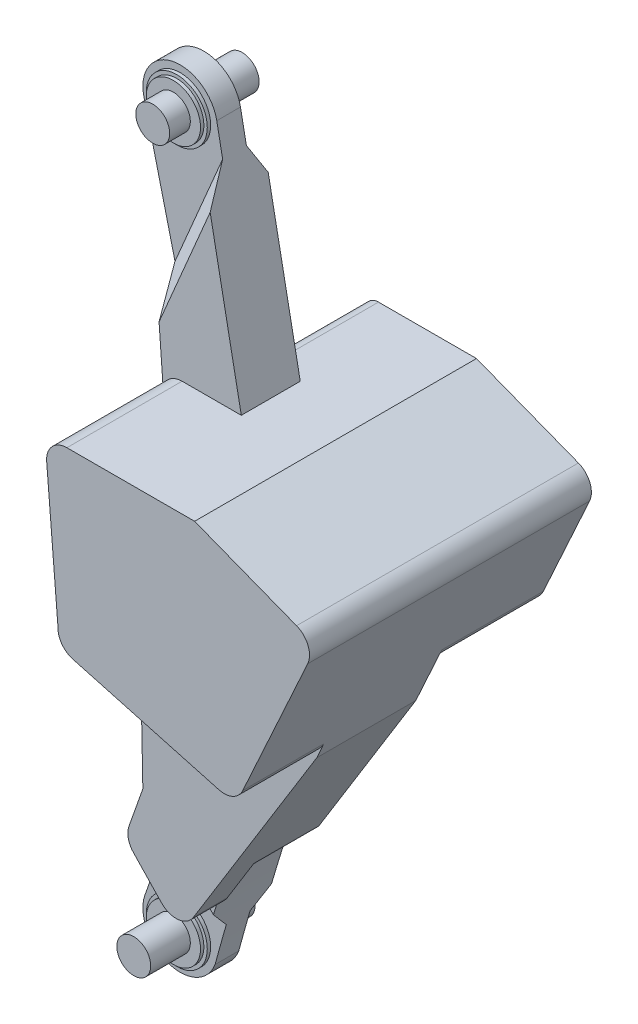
ISO-10303-21;
HEADER;
FILE_DESCRIPTION(('STEP AP214'),'2;1');
FILE_NAME('part.step','',(''),(''),'','','');
FILE_SCHEMA(('AUTOMOTIVE_DESIGN { 1 0 10303 214 1 1 1 1 }'));
ENDSEC;
DATA;
#1=APPLICATION_CONTEXT('core data for automotive mechanical design processes');
#2=APPLICATION_PROTOCOL_DEFINITION('international standard','automotive_design',2000,#1);
#3=PRODUCT_CONTEXT('',#1,'mechanical');
#4=PRODUCT('Part','Part','',(#3));
#5=PRODUCT_RELATED_PRODUCT_CATEGORY('part','',(#4));
#6=PRODUCT_DEFINITION_FORMATION('','',#4);
#7=PRODUCT_DEFINITION_CONTEXT('part definition',#1,'design');
#8=PRODUCT_DEFINITION('design','',#6,#7);
#9=PRODUCT_DEFINITION_SHAPE('','',#8);
#10=(LENGTH_UNIT() NAMED_UNIT(*) SI_UNIT(.MILLI.,.METRE.));
#11=(NAMED_UNIT(*) PLANE_ANGLE_UNIT() SI_UNIT($,.RADIAN.));
#12=(NAMED_UNIT(*) SI_UNIT($,.STERADIAN.) SOLID_ANGLE_UNIT());
#13=UNCERTAINTY_MEASURE_WITH_UNIT(LENGTH_MEASURE(1.E-05),#10,'distance_accuracy_value','');
#14=(GEOMETRIC_REPRESENTATION_CONTEXT(3) GLOBAL_UNCERTAINTY_ASSIGNED_CONTEXT((#13)) GLOBAL_UNIT_ASSIGNED_CONTEXT((#10,
#11,#12)) REPRESENTATION_CONTEXT('',''));
#15=CARTESIAN_POINT('',(0.,0.,0.));
#16=DIRECTION('',(0.,0.,1.));
#17=DIRECTION('',(1.,0.,0.));
#18=AXIS2_PLACEMENT_3D('',#15,#16,#17);
#19=CARTESIAN_POINT('',(52.1699902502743,1100.5616696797,-10.0054735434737));
#20=DIRECTION('',(0.,0.,-1.));
#21=DIRECTION('',(-1.,0.,0.));
#22=AXIS2_PLACEMENT_3D('',#19,#20,#21);
#23=PLANE('',#22);
#24=CARTESIAN_POINT('',(52.1699902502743,1100.5616696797,-10.0054735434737));
#25=DIRECTION('',(0.,0.,-1.));
#26=DIRECTION('',(-1.,0.,0.));
#27=AXIS2_PLACEMENT_3D('',#24,#25,#26);
#28=CIRCLE('',#27,40.);
#29=CARTESIAN_POINT('',(12.1699902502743,1100.5616696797,-10.0054735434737));
#30=VERTEX_POINT('',#29);
#31=EDGE_CURVE('E617',#30,#30,#28,.T.);
#32=ORIENTED_EDGE('',*,*,#31,.T.);
#33=EDGE_LOOP('',(#32));
#34=FACE_BOUND('',#33,.T.);
#35=CARTESIAN_POINT('',(52.1699902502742,1100.5616696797,-10.0054735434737));
#36=DIRECTION('',(0.,0.,-1.));
#37=DIRECTION('',(-1.,0.,0.));
#38=AXIS2_PLACEMENT_3D('',#35,#36,#37);
#39=CIRCLE('',#38,25.);
#40=CARTESIAN_POINT('',(27.1699902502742,1100.5616696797,-10.0054735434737));
#41=VERTEX_POINT('',#40);
#42=EDGE_CURVE('E1142',#41,#41,#39,.T.);
#43=ORIENTED_EDGE('',*,*,#42,.F.);
#44=EDGE_LOOP('',(#43));
#45=FACE_BOUND('',#44,.T.);
#46=ADVANCED_FACE('F17',(#34,#45),#23,.T.);
#47=CARTESIAN_POINT('',(52.1699902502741,1100.5616696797,44.9945264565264));
#48=DIRECTION('',(0.,0.,1.));
#49=DIRECTION('',(1.,0.,0.));
#50=AXIS2_PLACEMENT_3D('',#47,#48,#49);
#51=PLANE('',#50);
#52=CARTESIAN_POINT('',(52.1699902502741,1100.5616696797,44.9945264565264));
#53=DIRECTION('',(0.,0.,1.));
#54=DIRECTION('',(1.,0.,0.));
#55=AXIS2_PLACEMENT_3D('',#52,#53,#54);
#56=CIRCLE('',#55,40.);
#57=CARTESIAN_POINT('',(92.1699902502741,1100.5616696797,44.9945264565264));
#58=VERTEX_POINT('',#57);
#59=EDGE_CURVE('E614',#58,#58,#56,.T.);
#60=ORIENTED_EDGE('',*,*,#59,.T.);
#61=EDGE_LOOP('',(#60));
#62=FACE_BOUND('',#61,.T.);
#63=CARTESIAN_POINT('',(52.1699902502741,1100.5616696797,44.9945264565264));
#64=DIRECTION('',(0.,0.,1.));
#65=DIRECTION('',(1.,0.,0.));
#66=AXIS2_PLACEMENT_3D('',#63,#64,#65);
#67=CIRCLE('',#66,25.);
#68=CARTESIAN_POINT('',(77.1699902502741,1100.5616696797,44.9945264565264));
#69=VERTEX_POINT('',#68);
#70=EDGE_CURVE('E1141',#69,#69,#67,.T.);
#71=ORIENTED_EDGE('',*,*,#70,.F.);
#72=EDGE_LOOP('',(#71));
#73=FACE_BOUND('',#72,.T.);
#74=ADVANCED_FACE('F831',(#62,#73),#51,.T.);
#75=CARTESIAN_POINT('',(52.1699902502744,50.5616696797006,-10.0054735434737));
#76=DIRECTION('',(0.,0.,-1.));
#77=DIRECTION('',(-1.,0.,0.));
#78=AXIS2_PLACEMENT_3D('',#75,#76,#77);
#79=PLANE('',#78);
#80=CARTESIAN_POINT('',(52.1699902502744,50.5616696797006,-10.0054735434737));
#81=DIRECTION('',(0.,0.,-1.));
#82=DIRECTION('',(-1.,0.,0.));
#83=AXIS2_PLACEMENT_3D('',#80,#81,#82);
#84=CIRCLE('',#83,40.);
#85=CARTESIAN_POINT('',(12.1699902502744,50.5616696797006,-10.0054735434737));
#86=VERTEX_POINT('',#85);
#87=EDGE_CURVE('E608',#86,#86,#84,.T.);
#88=ORIENTED_EDGE('',*,*,#87,.T.);
#89=EDGE_LOOP('',(#88));
#90=FACE_BOUND('',#89,.T.);
#91=CARTESIAN_POINT('',(52.1699902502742,50.5616696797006,-10.0054735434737));
#92=DIRECTION('',(0.,0.,-1.));
#93=DIRECTION('',(-1.,0.,0.));
#94=AXIS2_PLACEMENT_3D('',#91,#92,#93);
#95=CIRCLE('',#94,25.);
#96=CARTESIAN_POINT('',(27.1699902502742,50.5616696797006,-10.0054735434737));
#97=VERTEX_POINT('',#96);
#98=EDGE_CURVE('E1151',#97,#97,#95,.T.);
#99=ORIENTED_EDGE('',*,*,#98,.F.);
#100=EDGE_LOOP('',(#99));
#101=FACE_BOUND('',#100,.T.);
#102=ADVANCED_FACE('F839',(#90,#101),#79,.T.);
#103=CARTESIAN_POINT('',(52.1699902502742,50.5616696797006,44.9945264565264));
#104=DIRECTION('',(0.,0.,1.));
#105=DIRECTION('',(1.,0.,0.));
#106=AXIS2_PLACEMENT_3D('',#103,#104,#105);
#107=PLANE('',#106);
#108=CARTESIAN_POINT('',(52.1699902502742,50.5616696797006,44.9945264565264));
#109=DIRECTION('',(0.,0.,1.));
#110=DIRECTION('',(1.,0.,0.));
#111=AXIS2_PLACEMENT_3D('',#108,#109,#110);
#112=CIRCLE('',#111,40.);
#113=CARTESIAN_POINT('',(92.1699902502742,50.5616696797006,44.9945264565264));
#114=VERTEX_POINT('',#113);
#115=EDGE_CURVE('E605',#114,#114,#112,.T.);
#116=ORIENTED_EDGE('',*,*,#115,.T.);
#117=EDGE_LOOP('',(#116));
#118=FACE_BOUND('',#117,.T.);
#119=CARTESIAN_POINT('',(52.1699902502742,50.5616696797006,44.9945264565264));
#120=DIRECTION('',(0.,0.,1.));
#121=DIRECTION('',(1.,0.,0.));
#122=AXIS2_PLACEMENT_3D('',#119,#120,#121);
#123=CIRCLE('',#122,25.);
#124=CARTESIAN_POINT('',(77.1699902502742,50.5616696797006,44.9945264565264));
#125=VERTEX_POINT('',#124);
#126=EDGE_CURVE('E377',#125,#125,#123,.T.);
#127=ORIENTED_EDGE('',*,*,#126,.F.);
#128=EDGE_LOOP('',(#127));
#129=FACE_BOUND('',#128,.T.);
#130=ADVANCED_FACE('F961',(#118,#129),#107,.T.);
#131=CARTESIAN_POINT('',(3964.69019911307,-1014.00064638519,34.9945264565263));
#132=DIRECTION('',(0.,0.,-1.));
#133=DIRECTION('',(-1.,0.,0.));
#134=AXIS2_PLACEMENT_3D('',#131,#132,#133);
#135=CYLINDRICAL_SURFACE('',#134,4000.);
#136=DIRECTION('',(0.,0.,1.));
#137=VECTOR('',#136,1.);
#138=CARTESIAN_POINT('',(157.495576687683,212.893443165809,-299.963916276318));
#139=LINE('',#138,#137);
#140=CARTESIAN_POINT('',(157.495576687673,212.893443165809,-24.0054735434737));
#141=VERTEX_POINT('',#140);
#142=CARTESIAN_POINT('',(157.495576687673,212.893443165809,62.9945264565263));
#143=VERTEX_POINT('',#142);
#144=EDGE_CURVE('E385',#141,#143,#139,.T.);
#145=ORIENTED_EDGE('',*,*,#144,.T.);
#146=CARTESIAN_POINT('',(3964.69019911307,-1014.00064638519,62.9945264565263));
#147=DIRECTION('',(0.,0.,1.));
#148=DIRECTION('',(0.,-1.,0.));
#149=AXIS2_PLACEMENT_3D('',#146,#147,#148);
#150=CIRCLE('',#149,4000.);
#151=CARTESIAN_POINT('',(135.243751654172,141.568436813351,62.9945264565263));
#152=VERTEX_POINT('',#151);
#153=EDGE_CURVE('E583',#152,#143,#150,.F.);
#154=ORIENTED_EDGE('',*,*,#153,.F.);
#155=CARTESIAN_POINT('',(3964.69019911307,-1014.00064638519,62.9945264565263));
#156=DIRECTION('',(0.,0.,-1.));
#157=DIRECTION('',(1.,0.,0.));
#158=AXIS2_PLACEMENT_3D('',#155,#156,#157);
#159=CIRCLE('',#158,4000.);
#160=CARTESIAN_POINT('',(129.292486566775,121.65968425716,62.9945264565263));
#161=VERTEX_POINT('',#160);
#162=EDGE_CURVE('E675',#161,#152,#159,.T.);
#163=ORIENTED_EDGE('',*,*,#162,.F.);
#164=CARTESIAN_POINT('',(3964.69019911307,-1014.00064638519,2060.50000915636));
#165=DIRECTION('',(0.512515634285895,0.487162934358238,-0.707106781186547));
#166=DIRECTION('',(-0.512515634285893,-0.487162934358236,-0.707106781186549));
#167=AXIS2_PLACEMENT_3D('',#164,#165,#166);
#168=ELLIPSE('',#167,5656.85424949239,4000.);
#169=CARTESIAN_POINT('',(120.221173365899,90.5616696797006,34.9945264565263));
#170=VERTEX_POINT('',#169);
#171=EDGE_CURVE('E801',#161,#170,#168,.F.);
#172=ORIENTED_EDGE('',*,*,#171,.T.);
#173=CARTESIAN_POINT('',(3964.69019911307,-1014.00064638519,34.9945264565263));
#174=DIRECTION('',(0.,0.,-1.));
#175=DIRECTION('',(-1.,0.,0.));
#176=AXIS2_PLACEMENT_3D('',#173,#174,#175);
#177=CIRCLE('',#176,4000.);
#178=CARTESIAN_POINT('',(103.686960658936,31.3002637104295,34.9945264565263));
#179=VERTEX_POINT('',#178);
#180=EDGE_CURVE('E749',#179,#170,#177,.T.);
#181=ORIENTED_EDGE('',*,*,#180,.F.);
#182=DIRECTION('',(0.,0.,-1.));
#183=VECTOR('',#182,1.);
#184=CARTESIAN_POINT('',(103.686960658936,31.3002637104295,34.9945264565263));
#185=LINE('',#184,#183);
#186=CARTESIAN_POINT('',(103.686960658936,31.3002637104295,-0.00547354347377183));
#187=VERTEX_POINT('',#186);
#188=EDGE_CURVE('E757',#179,#187,#185,.T.);
#189=ORIENTED_EDGE('',*,*,#188,.T.);
#190=CARTESIAN_POINT('',(3964.69019911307,-1014.00064638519,-0.00547354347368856));
#191=DIRECTION('',(0.,0.,-1.));
#192=DIRECTION('',(-1.,0.,0.));
#193=AXIS2_PLACEMENT_3D('',#190,#191,#192);
#194=CIRCLE('',#193,4000.);
#195=CARTESIAN_POINT('',(120.221173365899,90.5616696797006,-0.00547354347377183));
#196=VERTEX_POINT('',#195);
#197=EDGE_CURVE('E734',#187,#196,#194,.T.);
#198=ORIENTED_EDGE('',*,*,#197,.T.);
#199=CARTESIAN_POINT('',(3964.69019911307,-1014.00064638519,-2025.5109562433));
#200=DIRECTION('',(-0.512515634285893,-0.487162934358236,-0.707106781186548));
#201=DIRECTION('',(0.512515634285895,0.487162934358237,-0.707106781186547));
#202=AXIS2_PLACEMENT_3D('',#199,#200,#201);
#203=ELLIPSE('',#202,5656.85424949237,4000.);
#204=CARTESIAN_POINT('',(127.983803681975,117.230556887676,-24.0054735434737));
#205=VERTEX_POINT('',#204);
#206=EDGE_CURVE('E711',#196,#205,#203,.T.);
#207=ORIENTED_EDGE('',*,*,#206,.T.);
#208=CARTESIAN_POINT('',(3964.69019911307,-1014.00064638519,-24.0054735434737));
#209=DIRECTION('',(0.,0.,-1.));
#210=DIRECTION('',(1.,0.,0.));
#211=AXIS2_PLACEMENT_3D('',#208,#209,#210);
#212=CIRCLE('',#211,4000.);
#213=EDGE_CURVE('E33',#205,#141,#212,.T.);
#214=ORIENTED_EDGE('',*,*,#213,.T.);
#215=EDGE_LOOP('',(#145,#154,#163,#172,#181,#189,#198,#207,#214));
#216=FACE_BOUND('',#215,.T.);
#217=ADVANCED_FACE('F966',(#216),#135,.F.);
#218=CARTESIAN_POINT('',(145.581318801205,499.883655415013,500000.));
#219=DIRECTION('',(0.264252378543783,0.964453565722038,0.));
#220=DIRECTION('',(-0.964453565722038,0.264252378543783,0.));
#221=AXIS2_PLACEMENT_3D('',#218,#219,#220);
#222=PLANE('',#221);
#223=DIRECTION('',(0.,0.,-1.));
#224=VECTOR('',#223,1.);
#225=CARTESIAN_POINT('',(231.667125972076,476.296849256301,500000.));
#226=LINE('',#225,#224);
#227=CARTESIAN_POINT('',(231.667125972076,476.296849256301,-24.0054735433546));
#228=VERTEX_POINT('',#227);
#229=CARTESIAN_POINT('',(231.667125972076,476.296849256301,-33.0054735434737));
#230=VERTEX_POINT('',#229);
#231=EDGE_CURVE('E591',#228,#230,#226,.T.);
#232=ORIENTED_EDGE('',*,*,#231,.F.);
#233=DIRECTION('',(-0.964453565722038,0.264252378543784,0.));
#234=VECTOR('',#233,1.);
#235=CARTESIAN_POINT('',(231.667125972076,476.296849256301,-24.0054735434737));
#236=LINE('',#235,#234);
#237=CARTESIAN_POINT('',(145.581318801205,499.883655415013,-24.0054735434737));
#238=VERTEX_POINT('',#237);
#239=EDGE_CURVE('E370',#228,#238,#236,.T.);
#240=ORIENTED_EDGE('',*,*,#239,.T.);
#241=DIRECTION('',(0.,0.,1.));
#242=VECTOR('',#241,1.);
#243=CARTESIAN_POINT('',(145.581318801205,499.883655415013,-183.005473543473));
#244=LINE('',#243,#242);
#245=CARTESIAN_POINT('',(145.581318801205,499.883655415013,-183.005473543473));
#246=VERTEX_POINT('',#245);
#247=EDGE_CURVE('E569',#238,#246,#244,.F.);
#248=ORIENTED_EDGE('',*,*,#247,.T.);
#249=DIRECTION('',(-0.964453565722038,0.264252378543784,0.));
#250=VECTOR('',#249,1.);
#251=CARTESIAN_POINT('',(231.667125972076,476.296849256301,-183.005473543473));
#252=LINE('',#251,#250);
#253=CARTESIAN_POINT('',(231.667125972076,476.296849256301,-183.005473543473));
#254=VERTEX_POINT('',#253);
#255=EDGE_CURVE('E424',#254,#246,#252,.T.);
#256=ORIENTED_EDGE('',*,*,#255,.F.);
#257=DIRECTION('',(0.,0.,1.));
#258=VECTOR('',#257,1.);
#259=CARTESIAN_POINT('',(231.667125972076,476.296849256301,-183.005473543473));
#260=LINE('',#259,#258);
#261=EDGE_CURVE('E440',#254,#230,#260,.T.);
#262=ORIENTED_EDGE('',*,*,#261,.T.);
#263=EDGE_LOOP('',(#232,#240,#248,#256,#262));
#264=FACE_BOUND('',#263,.T.);
#265=ADVANCED_FACE('F981',(#264),#222,.F.);
#266=CARTESIAN_POINT('',(3966.19460881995,-1009.29005606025,-318.764821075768));
#267=DIRECTION('',(0.,0.,1.));
#268=DIRECTION('',(0.999999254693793,0.00122090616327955,0.));
#269=AXIS2_PLACEMENT_3D('',#266,#267,#268);
#270=CYLINDRICAL_SURFACE('',#269,3991.);
#271=CARTESIAN_POINT('',(3966.19460881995,-1009.29005606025,-24.0054735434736));
#272=DIRECTION('',(0.,0.,1.));
#273=DIRECTION('',(1.,0.,0.));
#274=AXIS2_PLACEMENT_3D('',#271,#272,#273);
#275=CIRCLE('',#274,3991.);
#276=CARTESIAN_POINT('',(171.175816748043,225.988603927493,-24.0054735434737));
#277=VERTEX_POINT('',#276);
#278=CARTESIAN_POINT('',(207.857169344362,333.461108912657,-24.0054735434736));
#279=VERTEX_POINT('',#278);
#280=EDGE_CURVE('E363',#277,#279,#275,.F.);
#281=ORIENTED_EDGE('',*,*,#280,.T.);
#282=DIRECTION('',(0.,0.,1.));
#283=VECTOR('',#282,1.);
#284=CARTESIAN_POINT('',(207.857169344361,333.461108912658,-318.764821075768));
#285=LINE('',#284,#283);
#286=CARTESIAN_POINT('',(207.857169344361,333.461108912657,-33.0054735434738));
#287=VERTEX_POINT('',#286);
#288=EDGE_CURVE('E348',#287,#279,#285,.T.);
#289=ORIENTED_EDGE('',*,*,#288,.F.);
#290=CARTESIAN_POINT('',(3966.19460881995,-1009.29005606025,-33.0054735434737));
#291=DIRECTION('',(0.,0.,-1.));
#292=DIRECTION('',(-0.999999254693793,-0.00122090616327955,0.));
#293=AXIS2_PLACEMENT_3D('',#290,#291,#292);
#294=CIRCLE('',#293,3991.);
#295=CARTESIAN_POINT('',(171.175816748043,225.988603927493,-33.0054735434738));
#296=VERTEX_POINT('',#295);
#297=EDGE_CURVE('E397',#296,#287,#294,.T.);
#298=ORIENTED_EDGE('',*,*,#297,.F.);
#299=DIRECTION('',(0.,0.,1.));
#300=VECTOR('',#299,1.);
#301=CARTESIAN_POINT('',(171.175816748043,225.988603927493,-318.764821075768));
#302=LINE('',#301,#300);
#303=EDGE_CURVE('E359',#296,#277,#302,.T.);
#304=ORIENTED_EDGE('',*,*,#303,.T.);
#305=EDGE_LOOP('',(#281,#289,#298,#304));
#306=FACE_BOUND('',#305,.T.);
#307=ADVANCED_FACE('F364',(#306),#270,.T.);
#308=CARTESIAN_POINT('',(180.684758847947,222.89344316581,-318.764821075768));
#309=DIRECTION('',(0.,0.,1.));
#310=DIRECTION('',(0.999999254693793,0.00122090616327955,0.));
#311=AXIS2_PLACEMENT_3D('',#308,#309,#310);
#312=CYLINDRICAL_SURFACE('',#311,9.9999999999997);
#313=DIRECTION('',(0.,0.,1.));
#314=VECTOR('',#313,1.);
#315=CARTESIAN_POINT('',(180.684758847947,212.893443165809,-299.963916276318));
#316=LINE('',#315,#314);
#317=CARTESIAN_POINT('',(180.684758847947,212.893443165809,-24.0054735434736));
#318=VERTEX_POINT('',#317);
#319=CARTESIAN_POINT('',(180.684758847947,212.893443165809,62.9945264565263));
#320=VERTEX_POINT('',#319);
#321=EDGE_CURVE('E41',#318,#320,#316,.T.);
#322=ORIENTED_EDGE('',*,*,#321,.F.);
#323=CARTESIAN_POINT('',(180.684758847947,222.89344316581,-24.0054735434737));
#324=DIRECTION('',(0.,0.,1.));
#325=DIRECTION('',(1.,0.,0.));
#326=AXIS2_PLACEMENT_3D('',#323,#324,#325);
#327=CIRCLE('',#326,9.99999999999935);
#328=EDGE_CURVE('E374',#318,#277,#327,.F.);
#329=ORIENTED_EDGE('',*,*,#328,.T.);
#330=ORIENTED_EDGE('',*,*,#303,.F.);
#331=CARTESIAN_POINT('',(180.684758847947,222.89344316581,-33.0054735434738));
#332=DIRECTION('',(0.,0.,-1.));
#333=DIRECTION('',(-0.999999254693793,-0.00122090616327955,0.));
#334=AXIS2_PLACEMENT_3D('',#331,#332,#333);
#335=CIRCLE('',#334,9.9999999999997);
#336=CARTESIAN_POINT('',(189.194381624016,217.641175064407,-33.0054735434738));
#337=VERTEX_POINT('',#336);
#338=EDGE_CURVE('E400',#337,#296,#335,.T.);
#339=ORIENTED_EDGE('',*,*,#338,.F.);
#340=DIRECTION('',(0.,0.,1.));
#341=VECTOR('',#340,1.);
#342=CARTESIAN_POINT('',(189.194381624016,217.641175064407,-318.764821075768));
#343=LINE('',#342,#341);
#344=CARTESIAN_POINT('',(189.194381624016,217.641175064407,62.9945264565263));
#345=VERTEX_POINT('',#344);
#346=EDGE_CURVE('E394',#337,#345,#343,.T.);
#347=ORIENTED_EDGE('',*,*,#346,.T.);
#348=CARTESIAN_POINT('',(180.684758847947,222.89344316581,62.9945264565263));
#349=DIRECTION('',(0.,0.,-1.));
#350=DIRECTION('',(-0.999999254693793,-0.00122090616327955,0.));
#351=AXIS2_PLACEMENT_3D('',#348,#349,#350);
#352=CIRCLE('',#351,9.9999999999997);
#353=EDGE_CURVE('E395',#345,#320,#352,.T.);
#354=ORIENTED_EDGE('',*,*,#353,.T.);
#355=EDGE_LOOP('',(#322,#329,#330,#339,#347,#354));
#356=FACE_BOUND('',#355,.T.);
#357=ADVANCED_FACE('F1058',(#356),#312,.T.);
#358=CARTESIAN_POINT('',(451.571489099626,710.98251710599,62.9945264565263));
#359=DIRECTION('',(0.,0.,1.));
#360=DIRECTION('',(0.999999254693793,0.00122090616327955,0.));
#361=AXIS2_PLACEMENT_3D('',#358,#359,#360);
#362=PLANE('',#361);
#363=DIRECTION('',(-1.,0.,0.));
#364=VECTOR('',#363,1.);
#365=CARTESIAN_POINT('',(180.684758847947,212.893443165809,62.9945264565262));
#366=LINE('',#365,#364);
#367=EDGE_CURVE('E382',#320,#143,#366,.T.);
#368=ORIENTED_EDGE('',*,*,#367,.F.);
#369=ORIENTED_EDGE('',*,*,#353,.F.);
#370=DIRECTION('',(-0.525226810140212,-0.850962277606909,0.));
#371=VECTOR('',#370,1.);
#372=CARTESIAN_POINT('',(129.292064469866,120.588604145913,62.9945264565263));
#373=LINE('',#372,#371);
#374=CARTESIAN_POINT('',(149.732955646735,153.706539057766,62.9945264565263));
#375=VERTEX_POINT('',#374);
#376=EDGE_CURVE('E408',#345,#375,#373,.T.);
#377=ORIENTED_EDGE('',*,*,#376,.T.);
#378=CARTESIAN_POINT('',(124.204087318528,169.463343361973,62.9945264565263));
#379=DIRECTION('',(0.,0.,1.));
#380=DIRECTION('',(0.999999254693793,0.00122090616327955,0.));
#381=AXIS2_PLACEMENT_3D('',#378,#379,#380);
#382=CIRCLE('',#381,30.);
#383=EDGE_CURVE('E535',#375,#152,#382,.F.);
#384=ORIENTED_EDGE('',*,*,#383,.T.);
#385=ORIENTED_EDGE('',*,*,#153,.T.);
#386=EDGE_LOOP('',(#368,#369,#377,#384,#385));
#387=FACE_BOUND('',#386,.T.);
#388=ADVANCED_FACE('F1020',(#387),#362,.F.);
#389=CARTESIAN_POINT('',(-177.299436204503,471.067028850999,-33.0054735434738));
#390=DIRECTION('',(0.,0.,1.));
#391=DIRECTION('',(0.999999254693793,0.00122090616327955,0.));
#392=AXIS2_PLACEMENT_3D('',#389,#390,#391);
#393=CYLINDRICAL_SURFACE('',#392,409.);
#394=CARTESIAN_POINT('',(-177.299436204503,471.067028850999,-24.0054735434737));
#395=DIRECTION('',(0.,0.,1.));
#396=DIRECTION('',(1.,0.,0.));
#397=AXIS2_PLACEMENT_3D('',#394,#395,#396);
#398=CIRCLE('',#397,409.);
#399=EDGE_CURVE('E352',#279,#228,#398,.T.);
#400=ORIENTED_EDGE('',*,*,#399,.T.);
#401=ORIENTED_EDGE('',*,*,#231,.T.);
#402=CARTESIAN_POINT('',(-177.299436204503,471.067028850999,-33.0054735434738));
#403=DIRECTION('',(0.,0.,1.));
#404=DIRECTION('',(-0.999999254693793,-0.00122090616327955,0.));
#405=AXIS2_PLACEMENT_3D('',#402,#403,#404);
#406=CIRCLE('',#405,409.);
#407=EDGE_CURVE('E355',#287,#230,#406,.T.);
#408=ORIENTED_EDGE('',*,*,#407,.F.);
#409=ORIENTED_EDGE('',*,*,#288,.T.);
#410=EDGE_LOOP('',(#400,#401,#408,#409));
#411=FACE_BOUND('',#410,.T.);
#412=ADVANCED_FACE('F350',(#411),#393,.F.);
#413=CARTESIAN_POINT('',(-176.993380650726,471.414152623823,-24.0054735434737));
#414=DIRECTION('',(0.,0.,1.));
#415=DIRECTION('',(1.,0.,0.));
#416=AXIS2_PLACEMENT_3D('',#413,#414,#415);
#417=PLANE('',#416);
#418=ORIENTED_EDGE('',*,*,#239,.F.);
#419=ORIENTED_EDGE('',*,*,#399,.F.);
#420=ORIENTED_EDGE('',*,*,#280,.F.);
#421=ORIENTED_EDGE('',*,*,#328,.F.);
#422=DIRECTION('',(1.,0.,0.));
#423=VECTOR('',#422,1.);
#424=CARTESIAN_POINT('',(180.684758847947,212.893443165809,-24.0054735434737));
#425=LINE('',#424,#423);
#426=EDGE_CURVE('E371',#141,#318,#425,.T.);
#427=ORIENTED_EDGE('',*,*,#426,.F.);
#428=ORIENTED_EDGE('',*,*,#213,.F.);
#429=DIRECTION('',(-0.688952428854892,0.724806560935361,0.));
#430=VECTOR('',#429,1.);
#431=CARTESIAN_POINT('',(55.8465931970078,193.121897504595,-24.0054735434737));
#432=LINE('',#431,#430);
#433=CARTESIAN_POINT('',(47.4388276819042,201.967215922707,-24.0054735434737));
#434=VERTEX_POINT('',#433);
#435=EDGE_CURVE('E781',#205,#434,#432,.T.);
#436=ORIENTED_EDGE('',*,*,#435,.T.);
#437=DIRECTION('',(-0.333806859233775,-0.942641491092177,0.));
#438=VECTOR('',#437,1.);
#439=CARTESIAN_POINT('',(75.1699902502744,280.277603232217,-24.0054735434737));
#440=LINE('',#439,#438);
#441=CARTESIAN_POINT('',(75.1699902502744,280.277603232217,-24.0054735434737));
#442=VERTEX_POINT('',#441);
#443=EDGE_CURVE('E685',#442,#434,#440,.T.);
#444=ORIENTED_EDGE('',*,*,#443,.F.);
#445=DIRECTION('',(0.0174524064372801,-0.999847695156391,0.));
#446=VECTOR('',#445,1.);
#447=CARTESIAN_POINT('',(70.5192164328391,546.720256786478,-24.0054735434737));
#448=LINE('',#447,#446);
#449=CARTESIAN_POINT('',(70.5192164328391,546.720256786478,-24.0054735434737));
#450=VERTEX_POINT('',#449);
#451=EDGE_CURVE('E682',#450,#442,#448,.T.);
#452=ORIENTED_EDGE('',*,*,#451,.F.);
#453=DIRECTION('',(0.0732381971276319,-0.997314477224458,0.));
#454=VECTOR('',#453,1.);
#455=CARTESIAN_POINT('',(44.5347273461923,900.5616696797,-24.0054735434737));
#456=LINE('',#455,#454);
#457=CARTESIAN_POINT('',(48.3801106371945,848.197513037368,-24.0054735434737));
#458=VERTEX_POINT('',#457);
#459=EDGE_CURVE('E680',#458,#450,#456,.T.);
#460=ORIENTED_EDGE('',*,*,#459,.F.);
#461=DIRECTION('',(0.390731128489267,0.920504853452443,0.));
#462=VECTOR('',#461,1.);
#463=CARTESIAN_POINT('',(136.959885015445,1056.87838407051,-24.0054735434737));
#464=LINE('',#463,#462);
#465=CARTESIAN_POINT('',(123.057099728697,1024.12547446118,-24.0054735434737));
#466=VERTEX_POINT('',#465);
#467=EDGE_CURVE('E778',#458,#466,#464,.T.);
#468=ORIENTED_EDGE('',*,*,#467,.T.);
#469=DIRECTION('',(-0.190808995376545,0.981627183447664,0.));
#470=VECTOR('',#469,1.);
#471=CARTESIAN_POINT('',(215.657492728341,547.737750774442,-24.0054735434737));
#472=LINE('',#471,#470);
#473=CARTESIAN_POINT('',(170.386023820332,780.639267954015,-24.0054735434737));
#474=VERTEX_POINT('',#473);
#475=EDGE_CURVE('E678',#474,#466,#472,.T.);
#476=ORIENTED_EDGE('',*,*,#475,.F.);
#477=DIRECTION('',(0.999999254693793,0.00122090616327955,0.));
#478=VECTOR('',#477,1.);
#479=CARTESIAN_POINT('',(101.486286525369,780.555147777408,-24.0054735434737));
#480=LINE('',#479,#478);
#481=CARTESIAN_POINT('',(126.85420382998,780.586119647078,-24.0054735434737));
#482=VERTEX_POINT('',#481);
#483=EDGE_CURVE('E417',#482,#474,#480,.T.);
#484=ORIENTED_EDGE('',*,*,#483,.F.);
#485=CARTESIAN_POINT('',(126.878621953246,760.586134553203,-24.0054735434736));
#486=DIRECTION('',(0.,0.,1.));
#487=DIRECTION('',(0.999999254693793,0.00122090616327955,0.));
#488=AXIS2_PLACEMENT_3D('',#485,#486,#487);
#489=CIRCLE('',#488,20.);
#490=CARTESIAN_POINT('',(107.436588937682,755.89493510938,-24.0054735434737));
#491=VERTEX_POINT('',#490);
#492=EDGE_CURVE('E576',#482,#491,#489,.T.);
#493=ORIENTED_EDGE('',*,*,#492,.T.);
#494=DIRECTION('',(-0.234559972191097,0.972101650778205,0.));
#495=VECTOR('',#494,1.);
#496=CARTESIAN_POINT('',(101.486286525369,780.555147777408,-24.0054735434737));
#497=LINE('',#496,#495);
#498=CARTESIAN_POINT('',(131.638877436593,655.591868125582,-24.0054735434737));
#499=VERTEX_POINT('',#498);
#500=EDGE_CURVE('E415',#499,#491,#497,.T.);
#501=ORIENTED_EDGE('',*,*,#500,.F.);
#502=DIRECTION('',(0.134115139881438,0.990965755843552,0.));
#503=VECTOR('',#502,1.);
#504=CARTESIAN_POINT('',(131.638877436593,655.591868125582,-24.0054735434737));
#505=LINE('',#504,#503);
#506=CARTESIAN_POINT('',(116.512783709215,543.826403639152,-24.0054735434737));
#507=VERTEX_POINT('',#506);
#508=EDGE_CURVE('E413',#507,#499,#505,.T.);
#509=ORIENTED_EDGE('',*,*,#508,.F.);
#510=CARTESIAN_POINT('',(156.151413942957,538.461798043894,-24.0054735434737));
#511=DIRECTION('',(0.,0.,1.));
#512=DIRECTION('',(0.999999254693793,0.00122090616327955,0.));
#513=AXIS2_PLACEMENT_3D('',#510,#511,#512);
#514=CIRCLE('',#513,40.);
#515=EDGE_CURVE('E567',#507,#238,#514,.T.);
#516=ORIENTED_EDGE('',*,*,#515,.T.);
#517=EDGE_LOOP('',(#418,#419,#420,#421,#427,#428,#436,#444,#452,#460,#468,#476,#484,#493,#501,
#509,#516));
#518=FACE_BOUND('',#517,.T.);
#519=ADVANCED_FACE('F368',(#518),#417,.F.);
#520=CARTESIAN_POINT('',(-176.993380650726,471.414152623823,62.9945264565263));
#521=DIRECTION('',(0.,0.,1.));
#522=DIRECTION('',(1.,0.,0.));
#523=AXIS2_PLACEMENT_3D('',#520,#521,#522);
#524=PLANE('',#523);
#525=CARTESIAN_POINT('',(107.609848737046,144.470719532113,62.9945264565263));
#526=VERTEX_POINT('',#525);
#527=EDGE_CURVE('E539',#152,#526,#382,.F.);
#528=ORIENTED_EDGE('',*,*,#527,.T.);
#529=DIRECTION('',(0.688952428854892,-0.724806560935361,0.));
#530=VECTOR('',#529,1.);
#531=CARTESIAN_POINT('',(-190.740195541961,458.347353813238,62.9945264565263));
#532=LINE('',#531,#530);
#533=EDGE_CURVE('E789',#526,#161,#532,.T.);
#534=ORIENTED_EDGE('',*,*,#533,.T.);
#535=ORIENTED_EDGE('',*,*,#162,.T.);
#536=EDGE_LOOP('',(#528,#534,#535));
#537=FACE_BOUND('',#536,.T.);
#538=ADVANCED_FACE('F915',(#537),#524,.T.);
#539=CARTESIAN_POINT('',(82.9507293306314,212.829152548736,62.9945264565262));
#540=DIRECTION('',(0.,0.,1.));
#541=DIRECTION('',(0.999999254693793,0.00122090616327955,0.));
#542=AXIS2_PLACEMENT_3D('',#539,#540,#541);
#543=CIRCLE('',#542,30.);
#544=CARTESIAN_POINT('',(57.095319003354,197.614102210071,62.9945264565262));
#545=VERTEX_POINT('',#544);
#546=CARTESIAN_POINT('',(53.8108171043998,219.961158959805,62.9945264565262));
#547=VERTEX_POINT('',#546);
#548=EDGE_CURVE('E534',#545,#547,#543,.F.);
#549=ORIENTED_EDGE('',*,*,#548,.T.);
#550=DIRECTION('',(-0.333806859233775,-0.942641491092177,0.));
#551=VECTOR('',#550,1.);
#552=CARTESIAN_POINT('',(75.1699902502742,280.277603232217,62.9945264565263));
#553=LINE('',#552,#551);
#554=CARTESIAN_POINT('',(48.9367596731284,206.197245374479,62.9945264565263));
#555=VERTEX_POINT('',#554);
#556=EDGE_CURVE('E672',#547,#555,#553,.T.);
#557=ORIENTED_EDGE('',*,*,#556,.T.);
#558=EDGE_CURVE('E790',#555,#545,#532,.T.);
#559=ORIENTED_EDGE('',*,*,#558,.T.);
#560=EDGE_LOOP('',(#549,#557,#559));
#561=FACE_BOUND('',#560,.T.);
#562=ADVANCED_FACE('F1389',(#561),#524,.T.);
#563=CARTESIAN_POINT('',(106.159485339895,1111.05616442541,34.9945264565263));
#564=DIRECTION('',(-0.981627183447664,-0.190808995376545,0.));
#565=DIRECTION('',(0.190808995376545,-0.981627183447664,0.));
#566=AXIS2_PLACEMENT_3D('',#563,#564,#565);
#567=PLANE('',#566);
#568=DIRECTION('',(0.,0.,1.));
#569=VECTOR('',#568,1.);
#570=CARTESIAN_POINT('',(170.386023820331,780.639267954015,34.9945264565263));
#571=LINE('',#570,#569);
#572=CARTESIAN_POINT('',(170.386023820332,780.639267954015,62.9945264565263));
#573=VERTEX_POINT('',#572);
#574=EDGE_CURVE('E593',#474,#573,#571,.T.);
#575=ORIENTED_EDGE('',*,*,#574,.F.);
#576=ORIENTED_EDGE('',*,*,#475,.T.);
#577=DIRECTION('',(-0.166539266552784,0.856770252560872,0.488067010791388));
#578=VECTOR('',#577,1.);
#579=CARTESIAN_POINT('',(114.867768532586,1066.25593115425,-0.00547354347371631));
#580=LINE('',#579,#578);
#581=CARTESIAN_POINT('',(114.867768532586,1066.25593115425,-0.00547354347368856));
#582=VERTEX_POINT('',#581);
#583=EDGE_CURVE('E787',#466,#582,#580,.T.);
#584=ORIENTED_EDGE('',*,*,#583,.T.);
#585=DIRECTION('',(-0.190808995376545,0.981627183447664,0.));
#586=VECTOR('',#585,1.);
#587=CARTESIAN_POINT('',(106.159485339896,1111.05616442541,-0.00547354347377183));
#588=LINE('',#587,#586);
#589=CARTESIAN_POINT('',(106.159485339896,1111.05616442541,-0.00547354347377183));
#590=VERTEX_POINT('',#589);
#591=EDGE_CURVE('E737',#582,#590,#588,.T.);
#592=ORIENTED_EDGE('',*,*,#591,.T.);
#593=DIRECTION('',(0.,0.,-1.));
#594=VECTOR('',#593,1.);
#595=CARTESIAN_POINT('',(106.159485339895,1111.05616442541,34.9945264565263));
#596=LINE('',#595,#594);
#597=CARTESIAN_POINT('',(106.159485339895,1111.05616442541,34.9945264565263));
#598=VERTEX_POINT('',#597);
#599=EDGE_CURVE('E754',#598,#590,#596,.T.);
#600=ORIENTED_EDGE('',*,*,#599,.F.);
#601=DIRECTION('',(-0.190808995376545,0.981627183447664,0.));
#602=VECTOR('',#601,1.);
#603=CARTESIAN_POINT('',(106.159485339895,1111.05616442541,34.9945264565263));
#604=LINE('',#603,#602);
#605=CARTESIAN_POINT('',(114.867768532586,1066.25593115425,34.9945264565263));
#606=VERTEX_POINT('',#605);
#607=EDGE_CURVE('E752',#606,#598,#604,.T.);
#608=ORIENTED_EDGE('',*,*,#607,.F.);
#609=DIRECTION('',(-0.166539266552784,0.85677025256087,-0.488067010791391));
#610=VECTOR('',#609,1.);
#611=CARTESIAN_POINT('',(199.145621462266,632.683964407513,281.982762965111));
#612=LINE('',#611,#610);
#613=CARTESIAN_POINT('',(124.421988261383,1017.103731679,62.9945264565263));
#614=VERTEX_POINT('',#613);
#615=EDGE_CURVE('E798',#606,#614,#612,.F.);
#616=ORIENTED_EDGE('',*,*,#615,.T.);
#617=DIRECTION('',(-0.190808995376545,0.981627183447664,0.));
#618=VECTOR('',#617,1.);
#619=CARTESIAN_POINT('',(215.657492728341,547.737750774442,62.9945264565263));
#620=LINE('',#619,#618);
#621=EDGE_CURVE('E665',#573,#614,#620,.T.);
#622=ORIENTED_EDGE('',*,*,#621,.F.);
#623=EDGE_LOOP('',(#575,#576,#584,#592,#600,#608,#616,#622));
#624=FACE_BOUND('',#623,.T.);
#625=ADVANCED_FACE('F924',(#624),#567,.F.);
#626=CARTESIAN_POINT('',(52.1699902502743,50.5616696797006,39.9945264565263));
#627=DIRECTION('',(0.,0.,1.));
#628=DIRECTION('',(1.,0.,0.));
#629=AXIS2_PLACEMENT_3D('',#626,#627,#628);
#630=PLANE('',#629);
#631=CARTESIAN_POINT('',(52.1699902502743,50.5616696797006,39.9945264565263));
#632=DIRECTION('',(0.,0.,1.));
#633=DIRECTION('',(1.,0.,0.));
#634=AXIS2_PLACEMENT_3D('',#631,#632,#633);
#635=CIRCLE('',#634,45.);
#636=CARTESIAN_POINT('',(97.1699902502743,50.5616696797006,39.9945264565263));
#637=VERTEX_POINT('',#636);
#638=EDGE_CURVE('E703',#637,#637,#635,.T.);
#639=ORIENTED_EDGE('',*,*,#638,.T.);
#640=EDGE_LOOP('',(#639));
#641=FACE_BOUND('',#640,.T.);
#642=CARTESIAN_POINT('',(52.1699902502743,50.5616696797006,39.9945264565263));
#643=DIRECTION('',(0.,0.,1.));
#644=DIRECTION('',(1.,0.,0.));
#645=AXIS2_PLACEMENT_3D('',#642,#643,#644);
#646=CIRCLE('',#645,40.);
#647=CARTESIAN_POINT('',(92.1699902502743,50.5616696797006,39.9945264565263));
#648=VERTEX_POINT('',#647);
#649=EDGE_CURVE('E602',#648,#648,#646,.T.);
#650=ORIENTED_EDGE('',*,*,#649,.F.);
#651=EDGE_LOOP('',(#650));
#652=FACE_BOUND('',#651,.T.);
#653=ADVANCED_FACE('F921',(#641,#652),#630,.T.);
#654=CARTESIAN_POINT('',(52.1699902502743,50.5616696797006,-5.00547354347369));
#655=DIRECTION('',(0.,0.,1.));
#656=DIRECTION('',(1.,0.,0.));
#657=AXIS2_PLACEMENT_3D('',#654,#655,#656);
#658=PLANE('',#657);
#659=CARTESIAN_POINT('',(52.1699902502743,50.5616696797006,-5.00547354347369));
#660=DIRECTION('',(0.,0.,1.));
#661=DIRECTION('',(1.,0.,0.));
#662=AXIS2_PLACEMENT_3D('',#659,#660,#661);
#663=CIRCLE('',#662,45.);
#664=CARTESIAN_POINT('',(97.1699902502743,50.5616696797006,-5.00547354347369));
#665=VERTEX_POINT('',#664);
#666=EDGE_CURVE('E700',#665,#665,#663,.T.);
#667=ORIENTED_EDGE('',*,*,#666,.F.);
#668=EDGE_LOOP('',(#667));
#669=FACE_BOUND('',#668,.T.);
#670=CARTESIAN_POINT('',(52.1699902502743,50.5616696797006,-5.00547354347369));
#671=DIRECTION('',(0.,0.,1.));
#672=DIRECTION('',(1.,0.,0.));
#673=AXIS2_PLACEMENT_3D('',#670,#671,#672);
#674=CIRCLE('',#673,40.);
#675=CARTESIAN_POINT('',(92.1699902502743,50.5616696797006,-5.00547354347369));
#676=VERTEX_POINT('',#675);
#677=EDGE_CURVE('E11',#676,#676,#674,.F.);
#678=ORIENTED_EDGE('',*,*,#677,.F.);
#679=EDGE_LOOP('',(#678));
#680=FACE_BOUND('',#679,.T.);
#681=ADVANCED_FACE('F825',(#669,#680),#658,.F.);
#682=CARTESIAN_POINT('',(52.1699902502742,1100.5616696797,39.9945264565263));
#683=DIRECTION('',(0.,0.,1.));
#684=DIRECTION('',(1.,0.,0.));
#685=AXIS2_PLACEMENT_3D('',#682,#683,#684);
#686=PLANE('',#685);
#687=CARTESIAN_POINT('',(52.1699902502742,1100.5616696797,39.9945264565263));
#688=DIRECTION('',(0.,0.,1.));
#689=DIRECTION('',(1.,0.,0.));
#690=AXIS2_PLACEMENT_3D('',#687,#688,#689);
#691=CIRCLE('',#690,45.);
#692=CARTESIAN_POINT('',(97.1699902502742,1100.5616696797,39.9945264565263));
#693=VERTEX_POINT('',#692);
#694=EDGE_CURVE('E716',#693,#693,#691,.T.);
#695=ORIENTED_EDGE('',*,*,#694,.T.);
#696=EDGE_LOOP('',(#695));
#697=FACE_BOUND('',#696,.T.);
#698=CARTESIAN_POINT('',(52.1699902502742,1100.5616696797,39.9945264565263));
#699=DIRECTION('',(0.,0.,1.));
#700=DIRECTION('',(1.,0.,0.));
#701=AXIS2_PLACEMENT_3D('',#698,#699,#700);
#702=CIRCLE('',#701,40.);
#703=CARTESIAN_POINT('',(92.1699902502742,1100.5616696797,39.9945264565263));
#704=VERTEX_POINT('',#703);
#705=EDGE_CURVE('E611',#704,#704,#702,.T.);
#706=ORIENTED_EDGE('',*,*,#705,.F.);
#707=EDGE_LOOP('',(#706));
#708=FACE_BOUND('',#707,.T.);
#709=ADVANCED_FACE('F813',(#697,#708),#686,.T.);
#710=CARTESIAN_POINT('',(52.1699902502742,1100.5616696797,-5.00547354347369));
#711=DIRECTION('',(0.,0.,1.));
#712=DIRECTION('',(1.,0.,0.));
#713=AXIS2_PLACEMENT_3D('',#710,#711,#712);
#714=PLANE('',#713);
#715=CARTESIAN_POINT('',(52.1699902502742,1100.5616696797,-5.00547354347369));
#716=DIRECTION('',(0.,0.,1.));
#717=DIRECTION('',(1.,0.,0.));
#718=AXIS2_PLACEMENT_3D('',#715,#716,#717);
#719=CIRCLE('',#718,45.);
#720=CARTESIAN_POINT('',(97.1699902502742,1100.5616696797,-5.00547354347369));
#721=VERTEX_POINT('',#720);
#722=EDGE_CURVE('E713',#721,#721,#719,.T.);
#723=ORIENTED_EDGE('',*,*,#722,.F.);
#724=EDGE_LOOP('',(#723));
#725=FACE_BOUND('',#724,.T.);
#726=CARTESIAN_POINT('',(52.1699902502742,1100.5616696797,-5.00547354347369));
#727=DIRECTION('',(0.,0.,1.));
#728=DIRECTION('',(1.,0.,0.));
#729=AXIS2_PLACEMENT_3D('',#726,#727,#728);
#730=CIRCLE('',#729,40.);
#731=CARTESIAN_POINT('',(92.1699902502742,1100.5616696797,-5.00547354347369));
#732=VERTEX_POINT('',#731);
#733=EDGE_CURVE('E26',#732,#732,#730,.F.);
#734=ORIENTED_EDGE('',*,*,#733,.F.);
#735=EDGE_LOOP('',(#734));
#736=FACE_BOUND('',#735,.T.);
#737=ADVANCED_FACE('F810',(#725,#736),#714,.F.);
#738=CARTESIAN_POINT('',(70.5192164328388,546.720256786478,34.9945264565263));
#739=DIRECTION('',(0.999847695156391,0.0174524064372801,0.));
#740=DIRECTION('',(-0.0174524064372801,0.999847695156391,0.));
#741=AXIS2_PLACEMENT_3D('',#738,#739,#740);
#742=PLANE('',#741);
#743=DIRECTION('',(0.,0.,-1.));
#744=VECTOR('',#743,1.);
#745=CARTESIAN_POINT('',(70.5192164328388,546.720256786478,34.9945264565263));
#746=LINE('',#745,#744);
#747=CARTESIAN_POINT('',(70.5192164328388,546.720256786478,62.9945264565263));
#748=VERTEX_POINT('',#747);
#749=EDGE_CURVE('E765',#748,#450,#746,.T.);
#750=ORIENTED_EDGE('',*,*,#749,.T.);
#751=ORIENTED_EDGE('',*,*,#451,.T.);
#752=DIRECTION('',(0.,0.,-1.));
#753=VECTOR('',#752,1.);
#754=CARTESIAN_POINT('',(75.1699902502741,280.277603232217,34.9945264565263));
#755=LINE('',#754,#753);
#756=CARTESIAN_POINT('',(75.1699902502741,280.277603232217,62.9945264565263));
#757=VERTEX_POINT('',#756);
#758=EDGE_CURVE('E763',#757,#442,#755,.T.);
#759=ORIENTED_EDGE('',*,*,#758,.F.);
#760=DIRECTION('',(0.0174524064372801,-0.999847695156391,0.));
#761=VECTOR('',#760,1.);
#762=CARTESIAN_POINT('',(70.5192164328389,546.720256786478,62.9945264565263));
#763=LINE('',#762,#761);
#764=EDGE_CURVE('E670',#748,#757,#763,.T.);
#765=ORIENTED_EDGE('',*,*,#764,.F.);
#766=EDGE_LOOP('',(#750,#751,#759,#765));
#767=FACE_BOUND('',#766,.T.);
#768=DIRECTION('',(-0.0174524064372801,0.999847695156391,0.));
#769=VECTOR('',#768,1.);
#770=CARTESIAN_POINT('',(72.1076800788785,455.71723545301,58.4945264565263));
#771=LINE('',#770,#769);
#772=CARTESIAN_POINT('',(74.7255410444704,305.74008117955,58.4945264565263));
#773=VERTEX_POINT('',#772);
#774=CARTESIAN_POINT('',(72.1076800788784,455.71723545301,58.4945264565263));
#775=VERTEX_POINT('',#774);
#776=EDGE_CURVE('E620',#773,#775,#771,.T.);
#777=ORIENTED_EDGE('',*,*,#776,.F.);
#778=DIRECTION('',(0.,0.,1.));
#779=VECTOR('',#778,1.);
#780=CARTESIAN_POINT('',(74.7255410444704,305.74008117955,58.4945264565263));
#781=LINE('',#780,#779);
#782=CARTESIAN_POINT('',(74.7255410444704,305.74008117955,8.49452645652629));
#783=VERTEX_POINT('',#782);
#784=EDGE_CURVE('E629',#783,#773,#781,.T.);
#785=ORIENTED_EDGE('',*,*,#784,.F.);
#786=DIRECTION('',(0.0174524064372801,-0.999847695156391,0.));
#787=VECTOR('',#786,1.);
#788=CARTESIAN_POINT('',(72.1076800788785,455.71723545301,8.49452645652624));
#789=LINE('',#788,#787);
#790=CARTESIAN_POINT('',(72.1076800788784,455.71723545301,8.49452645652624));
#791=VERTEX_POINT('',#790);
#792=EDGE_CURVE('E626',#791,#783,#789,.T.);
#793=ORIENTED_EDGE('',*,*,#792,.F.);
#794=DIRECTION('',(0.,0.,-1.));
#795=VECTOR('',#794,1.);
#796=CARTESIAN_POINT('',(72.1076800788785,455.71723545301,58.4945264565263));
#797=LINE('',#796,#795);
#798=EDGE_CURVE('E623',#775,#791,#797,.T.);
#799=ORIENTED_EDGE('',*,*,#798,.F.);
#800=EDGE_LOOP('',(#777,#785,#793,#799));
#801=FACE_BOUND('',#800,.T.);
#802=ADVANCED_FACE('F812',(#767,#801),#742,.F.);
#803=CARTESIAN_POINT('',(52.1699902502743,1100.5616696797,34.9945264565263));
#804=DIRECTION('',(0.,0.,-1.));
#805=DIRECTION('',(-1.,0.,0.));
#806=AXIS2_PLACEMENT_3D('',#803,#804,#805);
#807=PLANE('',#806);
#808=CARTESIAN_POINT('',(52.1699902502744,50.5616696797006,34.9945264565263));
#809=DIRECTION('',(0.,0.,-1.));
#810=DIRECTION('',(-1.,0.,0.));
#811=AXIS2_PLACEMENT_3D('',#808,#809,#810);
#812=CIRCLE('',#811,45.);
#813=CARTESIAN_POINT('',(7.16999025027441,50.5616696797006,34.9945264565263));
#814=VERTEX_POINT('',#813);
#815=EDGE_CURVE('E707',#814,#814,#812,.F.);
#816=ORIENTED_EDGE('',*,*,#815,.F.);
#817=EDGE_LOOP('',(#816));
#818=FACE_BOUND('',#817,.T.);
#819=ORIENTED_EDGE('',*,*,#180,.T.);
#820=DIRECTION('',(-0.688952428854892,0.724806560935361,0.));
#821=VECTOR('',#820,1.);
#822=CARTESIAN_POINT('',(-416.430504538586,655.141516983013,34.9945264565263));
#823=LINE('',#822,#821);
#824=CARTESIAN_POINT('',(38.4512357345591,176.587039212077,34.9945264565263));
#825=VERTEX_POINT('',#824);
#826=EDGE_CURVE('E698',#170,#825,#823,.T.);
#827=ORIENTED_EDGE('',*,*,#826,.T.);
#828=DIRECTION('',(-0.333806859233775,-0.942641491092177,0.));
#829=VECTOR('',#828,1.);
#830=CARTESIAN_POINT('',(75.1699902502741,280.277603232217,34.9945264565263));
#831=LINE('',#830,#829);
#832=CARTESIAN_POINT('',(0.324708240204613,68.9210469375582,34.9945264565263));
#833=VERTEX_POINT('',#832);
#834=EDGE_CURVE('E745',#825,#833,#831,.T.);
#835=ORIENTED_EDGE('',*,*,#834,.T.);
#836=CARTESIAN_POINT('',(52.1699902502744,50.5616696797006,34.9945264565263));
#837=DIRECTION('',(0.,0.,1.));
#838=DIRECTION('',(1.,0.,0.));
#839=AXIS2_PLACEMENT_3D('',#836,#837,#838);
#840=CIRCLE('',#839,55.);
#841=EDGE_CURVE('E747',#833,#179,#840,.T.);
#842=ORIENTED_EDGE('',*,*,#841,.T.);
#843=EDGE_LOOP('',(#819,#827,#835,#842));
#844=FACE_BOUND('',#843,.T.);
#845=ADVANCED_FACE('F822',(#818,#844),#807,.F.);
#846=CARTESIAN_POINT('',(52.1699902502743,1100.5616696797,-0.00547354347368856));
#847=DIRECTION('',(0.,0.,-1.));
#848=DIRECTION('',(-1.,0.,0.));
#849=AXIS2_PLACEMENT_3D('',#846,#847,#848);
#850=PLANE('',#849);
#851=DIRECTION('',(-0.688952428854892,0.724806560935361,0.));
#852=VECTOR('',#851,1.);
#853=CARTESIAN_POINT('',(-416.430504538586,655.141516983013,-0.00547354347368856));
#854=LINE('',#853,#852);
#855=CARTESIAN_POINT('',(38.4512357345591,176.587039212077,-0.00547354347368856));
#856=VERTEX_POINT('',#855);
#857=EDGE_CURVE('E695',#196,#856,#854,.T.);
#858=ORIENTED_EDGE('',*,*,#857,.F.);
#859=ORIENTED_EDGE('',*,*,#197,.F.);
#860=CARTESIAN_POINT('',(52.1699902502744,50.5616696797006,-0.00547354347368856));
#861=DIRECTION('',(0.,0.,1.));
#862=DIRECTION('',(1.,0.,0.));
#863=AXIS2_PLACEMENT_3D('',#860,#861,#862);
#864=CIRCLE('',#863,55.);
#865=CARTESIAN_POINT('',(0.324708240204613,68.9210469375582,-0.00547354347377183));
#866=VERTEX_POINT('',#865);
#867=EDGE_CURVE('E731',#866,#187,#864,.T.);
#868=ORIENTED_EDGE('',*,*,#867,.F.);
#869=DIRECTION('',(-0.333806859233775,-0.942641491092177,0.));
#870=VECTOR('',#869,1.);
#871=CARTESIAN_POINT('',(75.1699902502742,280.277603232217,-0.00547354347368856));
#872=LINE('',#871,#870);
#873=EDGE_CURVE('E729',#856,#866,#872,.T.);
#874=ORIENTED_EDGE('',*,*,#873,.F.);
#875=EDGE_LOOP('',(#858,#859,#868,#874));
#876=FACE_BOUND('',#875,.T.);
#877=CARTESIAN_POINT('',(52.1699902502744,50.5616696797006,-0.00547354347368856));
#878=DIRECTION('',(0.,0.,-1.));
#879=DIRECTION('',(-1.,0.,0.));
#880=AXIS2_PLACEMENT_3D('',#877,#878,#879);
#881=CIRCLE('',#880,45.);
#882=CARTESIAN_POINT('',(7.16999025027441,50.5616696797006,-0.00547354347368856));
#883=VERTEX_POINT('',#882);
#884=EDGE_CURVE('E706',#883,#883,#881,.F.);
#885=ORIENTED_EDGE('',*,*,#884,.T.);
#886=EDGE_LOOP('',(#885));
#887=FACE_BOUND('',#886,.T.);
#888=ADVANCED_FACE('F1564',(#876,#887),#850,.T.);
#889=CARTESIAN_POINT('',(52.1699902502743,1100.5616696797,34.9945264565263));
#890=DIRECTION('',(0.,0.,-1.));
#891=DIRECTION('',(-1.,0.,0.));
#892=AXIS2_PLACEMENT_3D('',#889,#890,#891);
#893=CIRCLE('',#892,45.);
#894=CARTESIAN_POINT('',(7.1699902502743,1100.5616696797,34.9945264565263));
#895=VERTEX_POINT('',#894);
#896=EDGE_CURVE('E712',#895,#895,#893,.F.);
#897=ORIENTED_EDGE('',*,*,#896,.F.);
#898=EDGE_LOOP('',(#897));
#899=FACE_BOUND('',#898,.T.);
#900=DIRECTION('',(0.23791992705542,-0.971284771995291,0.));
#901=VECTOR('',#900,1.);
#902=CARTESIAN_POINT('',(-1.25067220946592,1087.47607369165,34.9945264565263));
#903=LINE('',#902,#901);
#904=CARTESIAN_POINT('',(-1.25067220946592,1087.47607369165,34.9945264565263));
#905=VERTEX_POINT('',#904);
#906=CARTESIAN_POINT('',(44.5347273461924,900.5616696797,34.9945264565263));
#907=VERTEX_POINT('',#906);
#908=EDGE_CURVE('E742',#905,#907,#903,.T.);
#909=ORIENTED_EDGE('',*,*,#908,.T.);
#910=DIRECTION('',(0.390731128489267,0.920504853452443,0.));
#911=VECTOR('',#910,1.);
#912=CARTESIAN_POINT('',(117.634389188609,1072.77368097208,34.9945264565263));
#913=LINE('',#912,#911);
#914=EDGE_CURVE('E692',#907,#606,#913,.T.);
#915=ORIENTED_EDGE('',*,*,#914,.T.);
#916=ORIENTED_EDGE('',*,*,#607,.T.);
#917=CARTESIAN_POINT('',(52.1699902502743,1100.5616696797,34.9945264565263));
#918=DIRECTION('',(0.,0.,1.));
#919=DIRECTION('',(-1.,0.,0.));
#920=AXIS2_PLACEMENT_3D('',#917,#918,#919);
#921=CIRCLE('',#920,55.);
#922=EDGE_CURVE('E739',#598,#905,#921,.T.);
#923=ORIENTED_EDGE('',*,*,#922,.T.);
#924=EDGE_LOOP('',(#909,#915,#916,#923));
#925=FACE_BOUND('',#924,.T.);
#926=ADVANCED_FACE('F1561',(#899,#925),#807,.F.);
#927=DIRECTION('',(0.390731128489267,0.920504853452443,0.));
#928=VECTOR('',#927,1.);
#929=CARTESIAN_POINT('',(117.634389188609,1072.77368097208,-0.00547354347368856));
#930=LINE('',#929,#928);
#931=CARTESIAN_POINT('',(44.5347273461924,900.5616696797,-0.00547354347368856));
#932=VERTEX_POINT('',#931);
#933=EDGE_CURVE('E689',#932,#582,#930,.T.);
#934=ORIENTED_EDGE('',*,*,#933,.F.);
#935=DIRECTION('',(0.23791992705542,-0.971284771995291,0.));
#936=VECTOR('',#935,1.);
#937=CARTESIAN_POINT('',(-1.25067220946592,1087.47607369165,-0.00547354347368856));
#938=LINE('',#937,#936);
#939=CARTESIAN_POINT('',(-1.25067220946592,1087.47607369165,-0.00547354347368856));
#940=VERTEX_POINT('',#939);
#941=EDGE_CURVE('E726',#940,#932,#938,.T.);
#942=ORIENTED_EDGE('',*,*,#941,.F.);
#943=CARTESIAN_POINT('',(52.1699902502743,1100.5616696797,-0.00547354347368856));
#944=DIRECTION('',(0.,0.,1.));
#945=DIRECTION('',(-1.,0.,0.));
#946=AXIS2_PLACEMENT_3D('',#943,#944,#945);
#947=CIRCLE('',#946,55.);
#948=EDGE_CURVE('E723',#590,#940,#947,.T.);
#949=ORIENTED_EDGE('',*,*,#948,.F.);
#950=ORIENTED_EDGE('',*,*,#591,.F.);
#951=EDGE_LOOP('',(#934,#942,#949,#950));
#952=FACE_BOUND('',#951,.T.);
#953=CARTESIAN_POINT('',(52.1699902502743,1100.5616696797,-0.00547354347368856));
#954=DIRECTION('',(0.,0.,-1.));
#955=DIRECTION('',(-1.,0.,0.));
#956=AXIS2_PLACEMENT_3D('',#953,#954,#955);
#957=CIRCLE('',#956,45.);
#958=CARTESIAN_POINT('',(7.1699902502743,1100.5616696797,-0.00547354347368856));
#959=VERTEX_POINT('',#958);
#960=EDGE_CURVE('E719',#959,#959,#957,.F.);
#961=ORIENTED_EDGE('',*,*,#960,.T.);
#962=EDGE_LOOP('',(#961));
#963=FACE_BOUND('',#962,.T.);
#964=ADVANCED_FACE('F1554',(#952,#963),#850,.T.);
#965=CARTESIAN_POINT('',(52.1699902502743,1100.5616696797,34.9945264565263));
#966=DIRECTION('',(0.,0.,-1.));
#967=DIRECTION('',(-1.,0.,0.));
#968=AXIS2_PLACEMENT_3D('',#965,#966,#967);
#969=CYLINDRICAL_SURFACE('',#968,55.);
#970=ORIENTED_EDGE('',*,*,#948,.T.);
#971=DIRECTION('',(0.,0.,-1.));
#972=VECTOR('',#971,1.);
#973=CARTESIAN_POINT('',(-1.25067220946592,1087.47607369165,34.9945264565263));
#974=LINE('',#973,#972);
#975=EDGE_CURVE('E722',#905,#940,#974,.T.);
#976=ORIENTED_EDGE('',*,*,#975,.F.);
#977=ORIENTED_EDGE('',*,*,#922,.F.);
#978=ORIENTED_EDGE('',*,*,#599,.T.);
#979=EDGE_LOOP('',(#970,#976,#977,#978));
#980=FACE_BOUND('',#979,.T.);
#981=ADVANCED_FACE('F19',(#980),#969,.T.);
#982=CARTESIAN_POINT('',(-1.25067220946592,1087.47607369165,34.9945264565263));
#983=DIRECTION('',(0.971284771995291,0.23791992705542,0.));
#984=DIRECTION('',(-0.23791992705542,0.971284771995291,0.));
#985=AXIS2_PLACEMENT_3D('',#982,#983,#984);
#986=PLANE('',#985);
#987=ORIENTED_EDGE('',*,*,#941,.T.);
#988=DIRECTION('',(0.,0.,-1.));
#989=VECTOR('',#988,1.);
#990=CARTESIAN_POINT('',(44.5347273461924,900.5616696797,34.9945264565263));
#991=LINE('',#990,#989);
#992=EDGE_CURVE('E768',#907,#932,#991,.T.);
#993=ORIENTED_EDGE('',*,*,#992,.F.);
#994=ORIENTED_EDGE('',*,*,#908,.F.);
#995=ORIENTED_EDGE('',*,*,#975,.T.);
#996=EDGE_LOOP('',(#987,#993,#994,#995));
#997=FACE_BOUND('',#996,.T.);
#998=ADVANCED_FACE('F1540',(#997),#986,.F.);
#999=CARTESIAN_POINT('',(44.5347273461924,900.5616696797,34.9945264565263));
#1000=DIRECTION('',(0.997314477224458,0.0732381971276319,0.));
#1001=DIRECTION('',(-0.0732381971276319,0.997314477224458,0.));
#1002=AXIS2_PLACEMENT_3D('',#999,#1000,#1001);
#1003=PLANE('',#1002);
#1004=DIRECTION('',(0.0732381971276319,-0.997314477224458,0.));
#1005=VECTOR('',#1004,1.);
#1006=CARTESIAN_POINT('',(44.5347273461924,900.5616696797,62.9945264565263));
#1007=LINE('',#1006,#1005);
#1008=CARTESIAN_POINT('',(49.0210078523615,839.470153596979,62.9945264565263));
#1009=VERTEX_POINT('',#1008);
#1010=CARTESIAN_POINT('',(54.8082903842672,760.662360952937,62.9945264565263));
#1011=VERTEX_POINT('',#1010);
#1012=EDGE_CURVE('E667',#1009,#1011,#1007,.T.);
#1013=ORIENTED_EDGE('',*,*,#1012,.F.);
#1014=DIRECTION('',(0.0666094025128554,-0.907047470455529,0.415725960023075));
#1015=VECTOR('',#1014,1.);
#1016=CARTESIAN_POINT('',(72.0341782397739,526.090402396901,206.625485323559));
#1017=LINE('',#1016,#1015);
#1018=EDGE_CURVE('E796',#1009,#907,#1017,.F.);
#1019=ORIENTED_EDGE('',*,*,#1018,.T.);
#1020=ORIENTED_EDGE('',*,*,#992,.T.);
#1021=DIRECTION('',(0.0666094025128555,-0.90704747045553,-0.415725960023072));
#1022=VECTOR('',#1021,1.);
#1023=CARTESIAN_POINT('',(34.8358841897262,1032.6347827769,60.527435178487));
#1024=LINE('',#1023,#1022);
#1025=EDGE_CURVE('E785',#932,#458,#1024,.T.);
#1026=ORIENTED_EDGE('',*,*,#1025,.T.);
#1027=ORIENTED_EDGE('',*,*,#459,.T.);
#1028=ORIENTED_EDGE('',*,*,#749,.F.);
#1029=DIRECTION('',(0.0732381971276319,-0.997314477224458,0.));
#1030=VECTOR('',#1029,1.);
#1031=CARTESIAN_POINT('',(44.5347273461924,900.5616696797,62.9945264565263));
#1032=LINE('',#1031,#1030);
#1033=EDGE_CURVE('E589',#1011,#748,#1032,.T.);
#1034=ORIENTED_EDGE('',*,*,#1033,.F.);
#1035=EDGE_LOOP('',(#1013,#1019,#1020,#1026,#1027,#1028,#1034));
#1036=FACE_BOUND('',#1035,.T.);
#1037=ADVANCED_FACE('F1532',(#1036),#1003,.F.);
#1038=CARTESIAN_POINT('',(75.1699902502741,280.277603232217,34.9945264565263));
#1039=DIRECTION('',(0.942641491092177,-0.333806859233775,0.));
#1040=DIRECTION('',(0.333806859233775,0.942641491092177,0.));
#1041=AXIS2_PLACEMENT_3D('',#1038,#1039,#1040);
#1042=PLANE('',#1041);
#1043=ORIENTED_EDGE('',*,*,#834,.F.);
#1044=DIRECTION('',(-0.249181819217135,-0.703667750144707,-0.665402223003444));
#1045=VECTOR('',#1044,1.);
#1046=CARTESIAN_POINT('',(78.2671442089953,289.023696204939,141.316866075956));
#1047=LINE('',#1046,#1045);
#1048=EDGE_CURVE('E803',#825,#555,#1047,.F.);
#1049=ORIENTED_EDGE('',*,*,#1048,.T.);
#1050=ORIENTED_EDGE('',*,*,#556,.F.);
#1051=EDGE_CURVE('E673',#757,#547,#553,.T.);
#1052=ORIENTED_EDGE('',*,*,#1051,.F.);
#1053=ORIENTED_EDGE('',*,*,#758,.T.);
#1054=ORIENTED_EDGE('',*,*,#443,.T.);
#1055=DIRECTION('',(-0.249181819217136,-0.703667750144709,0.665402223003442));
#1056=VECTOR('',#1055,1.);
#1057=CARTESIAN_POINT('',(28.4446678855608,148.329363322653,26.7155469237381));
#1058=LINE('',#1057,#1056);
#1059=EDGE_CURVE('E783',#434,#856,#1058,.T.);
#1060=ORIENTED_EDGE('',*,*,#1059,.T.);
#1061=ORIENTED_EDGE('',*,*,#873,.T.);
#1062=DIRECTION('',(0.,0.,-1.));
#1063=VECTOR('',#1062,1.);
#1064=CARTESIAN_POINT('',(0.324708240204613,68.9210469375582,34.9945264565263));
#1065=LINE('',#1064,#1063);
#1066=EDGE_CURVE('E760',#833,#866,#1065,.T.);
#1067=ORIENTED_EDGE('',*,*,#1066,.F.);
#1068=EDGE_LOOP('',(#1043,#1049,#1050,#1052,#1053,#1054,#1060,#1061,#1067));
#1069=FACE_BOUND('',#1068,.T.);
#1070=ADVANCED_FACE('F1523',(#1069),#1042,.F.);
#1071=CARTESIAN_POINT('',(52.1699902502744,50.5616696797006,34.9945264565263));
#1072=DIRECTION('',(0.,0.,-1.));
#1073=DIRECTION('',(-1.,0.,0.));
#1074=AXIS2_PLACEMENT_3D('',#1071,#1072,#1073);
#1075=CYLINDRICAL_SURFACE('',#1074,55.);
#1076=ORIENTED_EDGE('',*,*,#867,.T.);
#1077=ORIENTED_EDGE('',*,*,#188,.F.);
#1078=ORIENTED_EDGE('',*,*,#841,.F.);
#1079=ORIENTED_EDGE('',*,*,#1066,.T.);
#1080=EDGE_LOOP('',(#1076,#1077,#1078,#1079));
#1081=FACE_BOUND('',#1080,.T.);
#1082=ADVANCED_FACE('F1514',(#1081),#1075,.T.);
#1083=CARTESIAN_POINT('',(52.1699902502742,1100.5616696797,39.9945264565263));
#1084=DIRECTION('',(0.,0.,-1.));
#1085=DIRECTION('',(-1.,0.,0.));
#1086=AXIS2_PLACEMENT_3D('',#1083,#1084,#1085);
#1087=CYLINDRICAL_SURFACE('',#1086,45.);
#1088=ORIENTED_EDGE('',*,*,#960,.F.);
#1089=EDGE_LOOP('',(#1088));
#1090=FACE_BOUND('',#1089,.T.);
#1091=ORIENTED_EDGE('',*,*,#722,.T.);
#1092=EDGE_LOOP('',(#1091));
#1093=FACE_BOUND('',#1092,.T.);
#1094=ADVANCED_FACE('F936',(#1090,#1093),#1087,.T.);
#1095=ORIENTED_EDGE('',*,*,#694,.F.);
#1096=EDGE_LOOP('',(#1095));
#1097=FACE_BOUND('',#1096,.T.);
#1098=ORIENTED_EDGE('',*,*,#896,.T.);
#1099=EDGE_LOOP('',(#1098));
#1100=FACE_BOUND('',#1099,.T.);
#1101=ADVANCED_FACE('F928',(#1097,#1100),#1087,.T.);
#1102=CARTESIAN_POINT('',(52.1699902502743,50.5616696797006,39.9945264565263));
#1103=DIRECTION('',(0.,0.,-1.));
#1104=DIRECTION('',(-1.,0.,0.));
#1105=AXIS2_PLACEMENT_3D('',#1102,#1103,#1104);
#1106=CYLINDRICAL_SURFACE('',#1105,45.);
#1107=ORIENTED_EDGE('',*,*,#884,.F.);
#1108=EDGE_LOOP('',(#1107));
#1109=FACE_BOUND('',#1108,.T.);
#1110=ORIENTED_EDGE('',*,*,#666,.T.);
#1111=EDGE_LOOP('',(#1110));
#1112=FACE_BOUND('',#1111,.T.);
#1113=ADVANCED_FACE('F926',(#1109,#1112),#1106,.T.);
#1114=ORIENTED_EDGE('',*,*,#638,.F.);
#1115=EDGE_LOOP('',(#1114));
#1116=FACE_BOUND('',#1115,.T.);
#1117=ORIENTED_EDGE('',*,*,#815,.T.);
#1118=EDGE_LOOP('',(#1117));
#1119=FACE_BOUND('',#1118,.T.);
#1120=ADVANCED_FACE('F913',(#1116,#1119),#1106,.T.);
#1121=DIRECTION('',(0.999999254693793,0.00122090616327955,0.));
#1122=VECTOR('',#1121,1.);
#1123=CARTESIAN_POINT('',(271.486159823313,780.762701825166,62.9945264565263));
#1124=LINE('',#1123,#1122);
#1125=CARTESIAN_POINT('',(83.0097259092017,780.532589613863,62.9945264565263));
#1126=VERTEX_POINT('',#1125);
#1127=EDGE_CURVE('E483',#1126,#573,#1124,.T.);
#1128=ORIENTED_EDGE('',*,*,#1127,.T.);
#1129=ORIENTED_EDGE('',*,*,#621,.T.);
#1130=DIRECTION('',(-0.390731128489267,-0.920504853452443,0.));
#1131=VECTOR('',#1130,1.);
#1132=CARTESIAN_POINT('',(-117.863458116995,446.314989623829,62.9945264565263));
#1133=LINE('',#1132,#1131);
#1134=EDGE_CURVE('E793',#614,#1009,#1133,.T.);
#1135=ORIENTED_EDGE('',*,*,#1134,.T.);
#1136=ORIENTED_EDGE('',*,*,#1012,.T.);
#1137=CARTESIAN_POINT('',(83.0463530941,750.532611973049,62.9945264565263));
#1138=DIRECTION('',(0.,0.,1.));
#1139=DIRECTION('',(0.999999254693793,0.00122090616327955,0.));
#1140=AXIS2_PLACEMENT_3D('',#1137,#1138,#1139);
#1141=CIRCLE('',#1140,30.);
#1142=EDGE_CURVE('E525',#1011,#1126,#1141,.F.);
#1143=ORIENTED_EDGE('',*,*,#1142,.T.);
#1144=EDGE_LOOP('',(#1128,#1129,#1135,#1136,#1143));
#1145=FACE_BOUND('',#1144,.T.);
#1146=ADVANCED_FACE('F909',(#1145),#524,.T.);
#1147=CARTESIAN_POINT('',(120.221173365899,90.5616696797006,-0.00547354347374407));
#1148=DIRECTION('',(-0.512515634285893,-0.487162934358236,-0.707106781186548));
#1149=DIRECTION('',(-0.809684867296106,0.,0.586864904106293));
#1150=AXIS2_PLACEMENT_3D('',#1147,#1148,#1149);
#1151=PLANE('',#1150);
#1152=ORIENTED_EDGE('',*,*,#1059,.F.);
#1153=ORIENTED_EDGE('',*,*,#435,.F.);
#1154=ORIENTED_EDGE('',*,*,#206,.F.);
#1155=ORIENTED_EDGE('',*,*,#857,.T.);
#1156=EDGE_LOOP('',(#1152,#1153,#1154,#1155));
#1157=FACE_BOUND('',#1156,.T.);
#1158=ADVANCED_FACE('F905',(#1157),#1151,.T.);
#1159=CARTESIAN_POINT('',(114.867768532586,1066.25593115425,-0.00547354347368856));
#1160=DIRECTION('',(-0.650895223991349,0.276288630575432,-0.707106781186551));
#1161=DIRECTION('',(-0.735745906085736,0.,0.67725767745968));
#1162=AXIS2_PLACEMENT_3D('',#1159,#1160,#1161);
#1163=PLANE('',#1162);
#1164=ORIENTED_EDGE('',*,*,#583,.F.);
#1165=ORIENTED_EDGE('',*,*,#467,.F.);
#1166=ORIENTED_EDGE('',*,*,#1025,.F.);
#1167=ORIENTED_EDGE('',*,*,#933,.T.);
#1168=EDGE_LOOP('',(#1164,#1165,#1166,#1167));
#1169=FACE_BOUND('',#1168,.T.);
#1170=ADVANCED_FACE('F901',(#1169),#1163,.T.);
#1171=CARTESIAN_POINT('',(-117.863458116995,446.314989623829,62.9945264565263));
#1172=DIRECTION('',(0.650895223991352,-0.276288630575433,-0.707106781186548));
#1173=DIRECTION('',(-0.735745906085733,0.,-0.677257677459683));
#1174=AXIS2_PLACEMENT_3D('',#1171,#1172,#1173);
#1175=PLANE('',#1174);
#1176=ORIENTED_EDGE('',*,*,#615,.F.);
#1177=ORIENTED_EDGE('',*,*,#914,.F.);
#1178=ORIENTED_EDGE('',*,*,#1018,.F.);
#1179=ORIENTED_EDGE('',*,*,#1134,.F.);
#1180=EDGE_LOOP('',(#1176,#1177,#1178,#1179));
#1181=FACE_BOUND('',#1180,.T.);
#1182=ADVANCED_FACE('F897',(#1181),#1175,.F.);
#1183=CARTESIAN_POINT('',(-190.740195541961,458.347353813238,62.9945264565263));
#1184=DIRECTION('',(0.512515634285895,0.487162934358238,-0.707106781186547));
#1185=DIRECTION('',(-0.809684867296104,0.,-0.586864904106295));
#1186=AXIS2_PLACEMENT_3D('',#1183,#1184,#1185);
#1187=PLANE('',#1186);
#1188=ORIENTED_EDGE('',*,*,#1048,.F.);
#1189=ORIENTED_EDGE('',*,*,#826,.F.);
#1190=ORIENTED_EDGE('',*,*,#171,.F.);
#1191=ORIENTED_EDGE('',*,*,#533,.F.);
#1192=DIRECTION('',(0.688952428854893,-0.72480656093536,0.));
#1193=VECTOR('',#1192,1.);
#1194=CARTESIAN_POINT('',(-190.740195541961,458.347353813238,62.9945264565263));
#1195=LINE('',#1194,#1193);
#1196=EDGE_CURVE('E586',#526,#545,#1195,.F.);
#1197=ORIENTED_EDGE('',*,*,#1196,.T.);
#1198=ORIENTED_EDGE('',*,*,#558,.F.);
#1199=EDGE_LOOP('',(#1188,#1189,#1190,#1191,#1197,#1198));
#1200=FACE_BOUND('',#1199,.T.);
#1201=ADVANCED_FACE('F876',(#1200),#1187,.F.);
#1202=CARTESIAN_POINT('',(27.1145337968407,454.931877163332,58.4945264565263));
#1203=DIRECTION('',(0.,0.,-1.));
#1204=DIRECTION('',(0.,1.,0.));
#1205=AXIS2_PLACEMENT_3D('',#1202,#1203,#1204);
#1206=PLANE('',#1205);
#1207=ORIENTED_EDGE('',*,*,#776,.T.);
#1208=DIRECTION('',(0.999847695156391,0.0174524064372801,0.));
#1209=VECTOR('',#1208,1.);
#1210=CARTESIAN_POINT('',(27.1145337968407,454.931877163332,58.4945264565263));
#1211=LINE('',#1210,#1209);
#1212=CARTESIAN_POINT('',(27.1145337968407,454.931877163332,58.4945264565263));
#1213=VERTEX_POINT('',#1212);
#1214=EDGE_CURVE('E650',#1213,#775,#1211,.T.);
#1215=ORIENTED_EDGE('',*,*,#1214,.F.);
#1216=DIRECTION('',(-0.0174524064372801,0.999847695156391,0.));
#1217=VECTOR('',#1216,1.);
#1218=CARTESIAN_POINT('',(27.1145337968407,454.931877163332,58.4945264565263));
#1219=LINE('',#1218,#1217);
#1220=CARTESIAN_POINT('',(29.7323947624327,304.954722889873,58.4945264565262));
#1221=VERTEX_POINT('',#1220);
#1222=EDGE_CURVE('E632',#1221,#1213,#1219,.T.);
#1223=ORIENTED_EDGE('',*,*,#1222,.F.);
#1224=DIRECTION('',(0.999847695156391,0.0174524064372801,0.));
#1225=VECTOR('',#1224,1.);
#1226=CARTESIAN_POINT('',(29.7323947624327,304.954722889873,58.4945264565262));
#1227=LINE('',#1226,#1225);
#1228=EDGE_CURVE('E641',#1221,#773,#1227,.T.);
#1229=ORIENTED_EDGE('',*,*,#1228,.T.);
#1230=EDGE_LOOP('',(#1207,#1215,#1223,#1229));
#1231=FACE_BOUND('',#1230,.T.);
#1232=ADVANCED_FACE('F872',(#1231),#1206,.F.);
#1233=CARTESIAN_POINT('',(27.1145337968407,454.931877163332,58.4945264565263));
#1234=DIRECTION('',(0.0174524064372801,-0.999847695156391,0.));
#1235=DIRECTION('',(0.999847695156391,0.0174524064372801,0.));
#1236=AXIS2_PLACEMENT_3D('',#1233,#1234,#1235);
#1237=PLANE('',#1236);
#1238=ORIENTED_EDGE('',*,*,#798,.T.);
#1239=DIRECTION('',(0.999847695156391,0.0174524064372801,0.));
#1240=VECTOR('',#1239,1.);
#1241=CARTESIAN_POINT('',(27.1145337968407,454.931877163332,8.49452645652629));
#1242=LINE('',#1241,#1240);
#1243=CARTESIAN_POINT('',(27.1145337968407,454.931877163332,8.49452645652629));
#1244=VERTEX_POINT('',#1243);
#1245=EDGE_CURVE('E647',#1244,#791,#1242,.T.);
#1246=ORIENTED_EDGE('',*,*,#1245,.F.);
#1247=DIRECTION('',(0.,0.,-1.));
#1248=VECTOR('',#1247,1.);
#1249=CARTESIAN_POINT('',(27.1145337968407,454.931877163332,58.4945264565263));
#1250=LINE('',#1249,#1248);
#1251=EDGE_CURVE('E635',#1213,#1244,#1250,.T.);
#1252=ORIENTED_EDGE('',*,*,#1251,.F.);
#1253=ORIENTED_EDGE('',*,*,#1214,.T.);
#1254=EDGE_LOOP('',(#1238,#1246,#1252,#1253));
#1255=FACE_BOUND('',#1254,.T.);
#1256=ADVANCED_FACE('F868',(#1255),#1237,.F.);
#1257=CARTESIAN_POINT('',(27.1145337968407,454.931877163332,8.49452645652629));
#1258=DIRECTION('',(0.,0.,1.));
#1259=DIRECTION('',(0.,-1.,0.));
#1260=AXIS2_PLACEMENT_3D('',#1257,#1258,#1259);
#1261=PLANE('',#1260);
#1262=ORIENTED_EDGE('',*,*,#792,.T.);
#1263=DIRECTION('',(0.999847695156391,0.0174524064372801,0.));
#1264=VECTOR('',#1263,1.);
#1265=CARTESIAN_POINT('',(29.7323947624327,304.954722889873,8.49452645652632));
#1266=LINE('',#1265,#1264);
#1267=CARTESIAN_POINT('',(29.7323947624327,304.954722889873,8.49452645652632));
#1268=VERTEX_POINT('',#1267);
#1269=EDGE_CURVE('E644',#1268,#783,#1266,.T.);
#1270=ORIENTED_EDGE('',*,*,#1269,.F.);
#1271=DIRECTION('',(0.0174524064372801,-0.999847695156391,0.));
#1272=VECTOR('',#1271,1.);
#1273=CARTESIAN_POINT('',(27.1145337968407,454.931877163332,8.49452645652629));
#1274=LINE('',#1273,#1272);
#1275=EDGE_CURVE('E637',#1244,#1268,#1274,.T.);
#1276=ORIENTED_EDGE('',*,*,#1275,.F.);
#1277=ORIENTED_EDGE('',*,*,#1245,.T.);
#1278=EDGE_LOOP('',(#1262,#1270,#1276,#1277));
#1279=FACE_BOUND('',#1278,.T.);
#1280=ADVANCED_FACE('F864',(#1279),#1261,.F.);
#1281=CARTESIAN_POINT('',(29.7323947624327,304.954722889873,58.4945264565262));
#1282=DIRECTION('',(-0.0174524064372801,0.999847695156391,0.));
#1283=DIRECTION('',(-0.999847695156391,-0.0174524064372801,0.));
#1284=AXIS2_PLACEMENT_3D('',#1281,#1282,#1283);
#1285=PLANE('',#1284);
#1286=ORIENTED_EDGE('',*,*,#784,.T.);
#1287=ORIENTED_EDGE('',*,*,#1228,.F.);
#1288=DIRECTION('',(0.,0.,1.));
#1289=VECTOR('',#1288,1.);
#1290=CARTESIAN_POINT('',(29.7323947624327,304.954722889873,58.4945264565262));
#1291=LINE('',#1290,#1289);
#1292=EDGE_CURVE('E639',#1268,#1221,#1291,.T.);
#1293=ORIENTED_EDGE('',*,*,#1292,.F.);
#1294=ORIENTED_EDGE('',*,*,#1269,.T.);
#1295=EDGE_LOOP('',(#1286,#1287,#1293,#1294));
#1296=FACE_BOUND('',#1295,.T.);
#1297=ADVANCED_FACE('F860',(#1296),#1285,.F.);
#1298=CARTESIAN_POINT('',(29.7323947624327,304.954722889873,58.4945264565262));
#1299=DIRECTION('',(0.999847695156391,0.0174524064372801,0.));
#1300=DIRECTION('',(-0.0174524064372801,0.999847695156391,0.));
#1301=AXIS2_PLACEMENT_3D('',#1298,#1299,#1300);
#1302=PLANE('',#1301);
#1303=ORIENTED_EDGE('',*,*,#1222,.T.);
#1304=ORIENTED_EDGE('',*,*,#1251,.T.);
#1305=ORIENTED_EDGE('',*,*,#1275,.T.);
#1306=ORIENTED_EDGE('',*,*,#1292,.T.);
#1307=EDGE_LOOP('',(#1303,#1304,#1305,#1306));
#1308=FACE_BOUND('',#1307,.T.);
#1309=ADVANCED_FACE('F848',(#1308),#1302,.F.);
#1310=CARTESIAN_POINT('',(52.1699902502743,1100.5616696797,-10.0054735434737));
#1311=DIRECTION('',(0.,0.,1.));
#1312=DIRECTION('',(1.,0.,0.));
#1313=AXIS2_PLACEMENT_3D('',#1310,#1311,#1312);
#1314=CYLINDRICAL_SURFACE('',#1313,40.);
#1315=ORIENTED_EDGE('',*,*,#31,.F.);
#1316=EDGE_LOOP('',(#1315));
#1317=FACE_BOUND('',#1316,.T.);
#1318=ORIENTED_EDGE('',*,*,#733,.T.);
#1319=EDGE_LOOP('',(#1318));
#1320=FACE_BOUND('',#1319,.T.);
#1321=ADVANCED_FACE('F808',(#1317,#1320),#1314,.T.);
#1322=CARTESIAN_POINT('',(52.1699902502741,1100.5616696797,44.9945264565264));
#1323=DIRECTION('',(0.,0.,-1.));
#1324=DIRECTION('',(-1.,0.,0.));
#1325=AXIS2_PLACEMENT_3D('',#1322,#1323,#1324);
#1326=CYLINDRICAL_SURFACE('',#1325,40.);
#1327=ORIENTED_EDGE('',*,*,#59,.F.);
#1328=EDGE_LOOP('',(#1327));
#1329=FACE_BOUND('',#1328,.T.);
#1330=ORIENTED_EDGE('',*,*,#705,.T.);
#1331=EDGE_LOOP('',(#1330));
#1332=FACE_BOUND('',#1331,.T.);
#1333=ADVANCED_FACE('F845',(#1329,#1332),#1326,.T.);
#1334=CARTESIAN_POINT('',(52.1699902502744,50.5616696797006,-10.0054735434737));
#1335=DIRECTION('',(0.,0.,1.));
#1336=DIRECTION('',(1.,0.,0.));
#1337=AXIS2_PLACEMENT_3D('',#1334,#1335,#1336);
#1338=CYLINDRICAL_SURFACE('',#1337,40.);
#1339=ORIENTED_EDGE('',*,*,#87,.F.);
#1340=EDGE_LOOP('',(#1339));
#1341=FACE_BOUND('',#1340,.T.);
#1342=ORIENTED_EDGE('',*,*,#677,.T.);
#1343=EDGE_LOOP('',(#1342));
#1344=FACE_BOUND('',#1343,.T.);
#1345=ADVANCED_FACE('F945',(#1341,#1344),#1338,.T.);
#1346=CARTESIAN_POINT('',(52.1699902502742,50.5616696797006,44.9945264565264));
#1347=DIRECTION('',(0.,0.,-1.));
#1348=DIRECTION('',(-1.,0.,0.));
#1349=AXIS2_PLACEMENT_3D('',#1346,#1347,#1348);
#1350=CYLINDRICAL_SURFACE('',#1349,40.);
#1351=ORIENTED_EDGE('',*,*,#115,.F.);
#1352=EDGE_LOOP('',(#1351));
#1353=FACE_BOUND('',#1352,.T.);
#1354=ORIENTED_EDGE('',*,*,#649,.T.);
#1355=EDGE_LOOP('',(#1354));
#1356=FACE_BOUND('',#1355,.T.);
#1357=ADVANCED_FACE('F947',(#1353,#1356),#1350,.T.);
#1358=CARTESIAN_POINT('',(178.885796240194,780.649645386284,500000.));
#1359=DIRECTION('',(0.00122090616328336,-0.999999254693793,0.));
#1360=DIRECTION('',(0.999999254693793,0.00122090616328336,0.));
#1361=AXIS2_PLACEMENT_3D('',#1358,#1359,#1360);
#1362=PLANE('',#1361);
#1363=ORIENTED_EDGE('',*,*,#574,.T.);
#1364=ORIENTED_EDGE('',*,*,#1127,.F.);
#1365=DIRECTION('',(0.,0.,-1.));
#1366=VECTOR('',#1365,1.);
#1367=CARTESIAN_POINT('',(83.0097259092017,780.532589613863,112.994526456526));
#1368=LINE('',#1367,#1366);
#1369=CARTESIAN_POINT('',(83.0097259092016,780.532589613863,232.994526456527));
#1370=VERTEX_POINT('',#1369);
#1371=EDGE_CURVE('E553',#1126,#1370,#1368,.F.);
#1372=ORIENTED_EDGE('',*,*,#1371,.T.);
#1373=DIRECTION('',(-0.999999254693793,-0.00122090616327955,0.));
#1374=VECTOR('',#1373,1.);
#1375=CARTESIAN_POINT('',(50.4863245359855,780.492881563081,232.994526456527));
#1376=LINE('',#1375,#1374);
#1377=CARTESIAN_POINT('',(271.486159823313,780.762701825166,232.994526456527));
#1378=VERTEX_POINT('',#1377);
#1379=EDGE_CURVE('E461',#1378,#1370,#1376,.T.);
#1380=ORIENTED_EDGE('',*,*,#1379,.F.);
#1381=DIRECTION('',(0.,0.,-1.));
#1382=VECTOR('',#1381,1.);
#1383=CARTESIAN_POINT('',(271.486159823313,780.762701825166,112.994526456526));
#1384=LINE('',#1383,#1382);
#1385=CARTESIAN_POINT('',(271.486159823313,780.762701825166,-183.005473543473));
#1386=VERTEX_POINT('',#1385);
#1387=EDGE_CURVE('E496',#1378,#1386,#1384,.T.);
#1388=ORIENTED_EDGE('',*,*,#1387,.T.);
#1389=DIRECTION('',(0.999999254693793,0.00122090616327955,0.));
#1390=VECTOR('',#1389,1.);
#1391=CARTESIAN_POINT('',(101.486286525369,780.555147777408,-183.005473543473));
#1392=LINE('',#1391,#1390);
#1393=CARTESIAN_POINT('',(126.854203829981,780.586119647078,-183.005473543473));
#1394=VERTEX_POINT('',#1393);
#1395=EDGE_CURVE('E432',#1394,#1386,#1392,.T.);
#1396=ORIENTED_EDGE('',*,*,#1395,.F.);
#1397=DIRECTION('',(0.,0.,1.));
#1398=VECTOR('',#1397,1.);
#1399=CARTESIAN_POINT('',(126.85420382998,780.586119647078,-24.0054735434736));
#1400=LINE('',#1399,#1398);
#1401=EDGE_CURVE('E573',#1394,#482,#1400,.T.);
#1402=ORIENTED_EDGE('',*,*,#1401,.T.);
#1403=ORIENTED_EDGE('',*,*,#483,.T.);
#1404=EDGE_LOOP('',(#1363,#1364,#1372,#1380,#1388,#1396,#1402,#1403));
#1405=FACE_BOUND('',#1404,.T.);
#1406=ADVANCED_FACE('F954',(#1405),#1362,.F.);
#1407=CARTESIAN_POINT('',(126.878621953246,760.586134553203,112.994526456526));
#1408=DIRECTION('',(0.,0.,-1.));
#1409=DIRECTION('',(-0.999999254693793,-0.00122090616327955,0.));
#1410=AXIS2_PLACEMENT_3D('',#1407,#1408,#1409);
#1411=CYLINDRICAL_SURFACE('',#1410,20.);
#1412=CARTESIAN_POINT('',(126.878621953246,760.586134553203,-183.005473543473));
#1413=DIRECTION('',(0.,0.,1.));
#1414=DIRECTION('',(0.999999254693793,0.00122090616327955,0.));
#1415=AXIS2_PLACEMENT_3D('',#1412,#1413,#1414);
#1416=CIRCLE('',#1415,20.);
#1417=CARTESIAN_POINT('',(107.436588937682,755.89493510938,-183.005473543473));
#1418=VERTEX_POINT('',#1417);
#1419=EDGE_CURVE('E581',#1418,#1394,#1416,.F.);
#1420=ORIENTED_EDGE('',*,*,#1419,.F.);
#1421=DIRECTION('',(0.,0.,1.));
#1422=VECTOR('',#1421,1.);
#1423=CARTESIAN_POINT('',(107.436588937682,755.89493510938,-183.005473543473));
#1424=LINE('',#1423,#1422);
#1425=EDGE_CURVE('E579',#491,#1418,#1424,.F.);
#1426=ORIENTED_EDGE('',*,*,#1425,.F.);
#1427=ORIENTED_EDGE('',*,*,#492,.F.);
#1428=ORIENTED_EDGE('',*,*,#1401,.F.);
#1429=EDGE_LOOP('',(#1420,#1426,#1427,#1428));
#1430=FACE_BOUND('',#1429,.T.);
#1431=ADVANCED_FACE('F979',(#1430),#1411,.T.);
#1432=CARTESIAN_POINT('',(156.151413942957,538.461798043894,-183.005473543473));
#1433=DIRECTION('',(0.,0.,1.));
#1434=DIRECTION('',(0.999999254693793,0.00122090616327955,0.));
#1435=AXIS2_PLACEMENT_3D('',#1432,#1433,#1434);
#1436=CYLINDRICAL_SURFACE('',#1435,40.);
#1437=CARTESIAN_POINT('',(156.151413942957,538.461798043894,-183.005473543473));
#1438=DIRECTION('',(0.,0.,1.));
#1439=DIRECTION('',(0.999999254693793,0.00122090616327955,0.));
#1440=AXIS2_PLACEMENT_3D('',#1437,#1438,#1439);
#1441=CIRCLE('',#1440,40.);
#1442=CARTESIAN_POINT('',(116.512783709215,543.826403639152,-183.005473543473));
#1443=VERTEX_POINT('',#1442);
#1444=EDGE_CURVE('E571',#246,#1443,#1441,.F.);
#1445=ORIENTED_EDGE('',*,*,#1444,.F.);
#1446=ORIENTED_EDGE('',*,*,#247,.F.);
#1447=ORIENTED_EDGE('',*,*,#515,.F.);
#1448=DIRECTION('',(0.,0.,1.));
#1449=VECTOR('',#1448,1.);
#1450=CARTESIAN_POINT('',(116.512783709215,543.826403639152,-183.005473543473));
#1451=LINE('',#1450,#1449);
#1452=EDGE_CURVE('E564',#1443,#507,#1451,.T.);
#1453=ORIENTED_EDGE('',*,*,#1452,.F.);
#1454=EDGE_LOOP('',(#1445,#1446,#1447,#1453));
#1455=FACE_BOUND('',#1454,.T.);
#1456=ADVANCED_FACE('F1085',(#1455),#1436,.T.);
#1457=CARTESIAN_POINT('',(411.069391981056,694.503003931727,112.994526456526));
#1458=DIRECTION('',(0.,0.,-1.));
#1459=DIRECTION('',(-0.999999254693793,-0.00122090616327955,0.));
#1460=AXIS2_PLACEMENT_3D('',#1457,#1458,#1459);
#1461=CYLINDRICAL_SURFACE('',#1460,30.);
#1462=CARTESIAN_POINT('',(411.069391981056,694.503003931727,232.994526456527));
#1463=DIRECTION('',(0.,0.,1.));
#1464=DIRECTION('',(0.999999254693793,0.00122090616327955,0.));
#1465=AXIS2_PLACEMENT_3D('',#1462,#1463,#1464);
#1466=CIRCLE('',#1465,30.);
#1467=CARTESIAN_POINT('',(438.359853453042,682.043842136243,232.994526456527));
#1468=VERTEX_POINT('',#1467);
#1469=CARTESIAN_POINT('',(421.90863500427,722.476398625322,232.994526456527));
#1470=VERTEX_POINT('',#1469);
#1471=EDGE_CURVE('E516',#1468,#1470,#1466,.T.);
#1472=ORIENTED_EDGE('',*,*,#1471,.F.);
#1473=DIRECTION('',(0.,0.,-1.));
#1474=VECTOR('',#1473,1.);
#1475=CARTESIAN_POINT('',(438.359853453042,682.043842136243,112.994526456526));
#1476=LINE('',#1475,#1474);
#1477=CARTESIAN_POINT('',(438.359853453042,682.043842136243,-183.005473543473));
#1478=VERTEX_POINT('',#1477);
#1479=EDGE_CURVE('E1693',#1478,#1468,#1476,.F.);
#1480=ORIENTED_EDGE('',*,*,#1479,.F.);
#1481=CARTESIAN_POINT('',(411.069391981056,694.503003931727,-183.005473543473));
#1482=DIRECTION('',(0.,0.,1.));
#1483=DIRECTION('',(0.999999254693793,0.00122090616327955,0.));
#1484=AXIS2_PLACEMENT_3D('',#1481,#1482,#1483);
#1485=CIRCLE('',#1484,30.);
#1486=CARTESIAN_POINT('',(421.90863500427,722.476398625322,-183.005473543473));
#1487=VERTEX_POINT('',#1486);
#1488=EDGE_CURVE('E1698',#1487,#1478,#1485,.F.);
#1489=ORIENTED_EDGE('',*,*,#1488,.F.);
#1490=DIRECTION('',(0.,0.,-1.));
#1491=VECTOR('',#1490,1.);
#1492=CARTESIAN_POINT('',(421.90863500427,722.476398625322,112.994526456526));
#1493=LINE('',#1492,#1491);
#1494=EDGE_CURVE('E555',#1470,#1487,#1493,.T.);
#1495=ORIENTED_EDGE('',*,*,#1494,.F.);
#1496=EDGE_LOOP('',(#1472,#1480,#1489,#1495));
#1497=FACE_BOUND('',#1496,.T.);
#1498=ADVANCED_FACE('F1081',(#1497),#1461,.T.);
#1499=CARTESIAN_POINT('',(83.0463530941,750.532611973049,112.994526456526));
#1500=DIRECTION('',(0.,0.,-1.));
#1501=DIRECTION('',(-0.999999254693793,-0.00122090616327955,0.));
#1502=AXIS2_PLACEMENT_3D('',#1499,#1500,#1501);
#1503=CYLINDRICAL_SURFACE('',#1502,30.);
#1504=CARTESIAN_POINT('',(83.0463530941,750.532611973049,232.994526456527));
#1505=DIRECTION('',(0.,0.,1.));
#1506=DIRECTION('',(0.999999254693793,0.00122090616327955,0.));
#1507=AXIS2_PLACEMENT_3D('',#1504,#1505,#1506);
#1508=CIRCLE('',#1507,30.);
#1509=CARTESIAN_POINT('',(53.1469023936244,748.078462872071,232.994526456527));
#1510=VERTEX_POINT('',#1509);
#1511=EDGE_CURVE('E518',#1370,#1510,#1508,.T.);
#1512=ORIENTED_EDGE('',*,*,#1511,.F.);
#1513=ORIENTED_EDGE('',*,*,#1371,.F.);
#1514=ORIENTED_EDGE('',*,*,#1142,.F.);
#1515=CARTESIAN_POINT('',(53.1469023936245,748.078462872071,62.9945264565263));
#1516=VERTEX_POINT('',#1515);
#1517=EDGE_CURVE('E526',#1516,#1011,#1141,.F.);
#1518=ORIENTED_EDGE('',*,*,#1517,.F.);
#1519=DIRECTION('',(0.,0.,-1.));
#1520=VECTOR('',#1519,1.);
#1521=CARTESIAN_POINT('',(53.1469023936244,748.078462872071,112.994526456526));
#1522=LINE('',#1521,#1520);
#1523=EDGE_CURVE('E550',#1510,#1516,#1522,.T.);
#1524=ORIENTED_EDGE('',*,*,#1523,.F.);
#1525=EDGE_LOOP('',(#1512,#1513,#1514,#1518,#1524));
#1526=FACE_BOUND('',#1525,.T.);
#1527=ADVANCED_FACE('F1077',(#1526),#1503,.T.);
#1528=CARTESIAN_POINT('',(82.9507293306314,212.829152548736,112.994526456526));
#1529=DIRECTION('',(0.,0.,-1.));
#1530=DIRECTION('',(-0.999999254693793,-0.00122090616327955,0.));
#1531=AXIS2_PLACEMENT_3D('',#1528,#1529,#1530);
#1532=CYLINDRICAL_SURFACE('',#1531,30.);
#1533=CARTESIAN_POINT('',(82.9507293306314,212.829152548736,112.994526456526));
#1534=DIRECTION('',(0.,0.,1.));
#1535=DIRECTION('',(0.999999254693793,0.00122090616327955,0.));
#1536=AXIS2_PLACEMENT_3D('',#1533,#1534,#1535);
#1537=CIRCLE('',#1536,30.);
#1538=CARTESIAN_POINT('',(54.6714845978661,222.84335832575,112.994526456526));
#1539=VERTEX_POINT('',#1538);
#1540=CARTESIAN_POINT('',(61.2147269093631,192.151962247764,112.994526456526));
#1541=VERTEX_POINT('',#1540);
#1542=EDGE_CURVE('E544',#1539,#1541,#1537,.T.);
#1543=ORIENTED_EDGE('',*,*,#1542,.F.);
#1544=DIRECTION('',(0.,0.,-1.));
#1545=VECTOR('',#1544,1.);
#1546=CARTESIAN_POINT('',(54.6714845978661,222.84335832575,112.994526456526));
#1547=LINE('',#1546,#1545);
#1548=CARTESIAN_POINT('',(54.6714845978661,222.84335832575,62.9945264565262));
#1549=VERTEX_POINT('',#1548);
#1550=EDGE_CURVE('E548',#1549,#1539,#1547,.F.);
#1551=ORIENTED_EDGE('',*,*,#1550,.F.);
#1552=EDGE_CURVE('E529',#547,#1549,#543,.F.);
#1553=ORIENTED_EDGE('',*,*,#1552,.F.);
#1554=ORIENTED_EDGE('',*,*,#548,.F.);
#1555=CARTESIAN_POINT('',(61.2147269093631,192.151962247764,62.9945264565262));
#1556=VERTEX_POINT('',#1555);
#1557=EDGE_CURVE('E530',#1556,#545,#543,.F.);
#1558=ORIENTED_EDGE('',*,*,#1557,.F.);
#1559=DIRECTION('',(0.,0.,-1.));
#1560=VECTOR('',#1559,1.);
#1561=CARTESIAN_POINT('',(61.2147269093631,192.151962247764,112.994526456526));
#1562=LINE('',#1561,#1560);
#1563=EDGE_CURVE('E538',#1541,#1556,#1562,.T.);
#1564=ORIENTED_EDGE('',*,*,#1563,.F.);
#1565=EDGE_LOOP('',(#1543,#1551,#1553,#1554,#1558,#1564));
#1566=FACE_BOUND('',#1565,.T.);
#1567=ADVANCED_FACE('F1073',(#1566),#1532,.T.);
#1568=CARTESIAN_POINT('',(124.204087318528,169.463343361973,-322.742430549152));
#1569=DIRECTION('',(0.,0.,-1.));
#1570=DIRECTION('',(-0.999999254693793,-0.00122090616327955,0.));
#1571=AXIS2_PLACEMENT_3D('',#1568,#1569,#1570);
#1572=CYLINDRICAL_SURFACE('',#1571,30.);
#1573=CARTESIAN_POINT('',(124.204087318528,169.463343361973,112.994526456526));
#1574=DIRECTION('',(0.,0.,1.));
#1575=DIRECTION('',(0.999999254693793,0.00122090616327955,0.));
#1576=AXIS2_PLACEMENT_3D('',#1573,#1574,#1575);
#1577=CIRCLE('',#1576,30.);
#1578=CARTESIAN_POINT('',(102.468084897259,148.786153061,112.994526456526));
#1579=VERTEX_POINT('',#1578);
#1580=CARTESIAN_POINT('',(149.732955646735,153.706539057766,112.994526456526));
#1581=VERTEX_POINT('',#1580);
#1582=EDGE_CURVE('E546',#1579,#1581,#1577,.T.);
#1583=ORIENTED_EDGE('',*,*,#1582,.F.);
#1584=DIRECTION('',(0.,0.,-1.));
#1585=VECTOR('',#1584,1.);
#1586=CARTESIAN_POINT('',(102.468084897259,148.786153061,112.994526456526));
#1587=LINE('',#1586,#1585);
#1588=CARTESIAN_POINT('',(102.468084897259,148.786153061,62.9945264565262));
#1589=VERTEX_POINT('',#1588);
#1590=EDGE_CURVE('E542',#1589,#1579,#1587,.F.);
#1591=ORIENTED_EDGE('',*,*,#1590,.F.);
#1592=EDGE_CURVE('E533',#526,#1589,#382,.F.);
#1593=ORIENTED_EDGE('',*,*,#1592,.F.);
#1594=ORIENTED_EDGE('',*,*,#527,.F.);
#1595=ORIENTED_EDGE('',*,*,#383,.F.);
#1596=DIRECTION('',(0.,0.,-1.));
#1597=VECTOR('',#1596,1.);
#1598=CARTESIAN_POINT('',(149.732955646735,153.706539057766,-322.742430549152));
#1599=LINE('',#1598,#1597);
#1600=EDGE_CURVE('E522',#1581,#375,#1599,.T.);
#1601=ORIENTED_EDGE('',*,*,#1600,.F.);
#1602=EDGE_LOOP('',(#1583,#1591,#1593,#1594,#1595,#1601));
#1603=FACE_BOUND('',#1602,.T.);
#1604=ADVANCED_FACE('F1069',(#1603),#1572,.T.);
#1605=CARTESIAN_POINT('',(99.8192232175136,543.527791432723,232.994526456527));
#1606=DIRECTION('',(0.,0.,1.));
#1607=DIRECTION('',(0.999999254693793,0.00122090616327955,0.));
#1608=AXIS2_PLACEMENT_3D('',#1605,#1606,#1607);
#1609=CYLINDRICAL_SURFACE('',#1608,30.);
#1610=CARTESIAN_POINT('',(99.8192232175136,543.527791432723,232.994526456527));
#1611=DIRECTION('',(0.,0.,1.));
#1612=DIRECTION('',(0.999999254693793,0.00122090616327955,0.));
#1613=AXIS2_PLACEMENT_3D('',#1610,#1611,#1612);
#1614=CIRCLE('',#1613,30.);
#1615=CARTESIAN_POINT('',(69.8252750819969,542.925234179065,232.994526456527));
#1616=VERTEX_POINT('',#1615);
#1617=CARTESIAN_POINT('',(91.8916518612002,514.594184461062,232.994526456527));
#1618=VERTEX_POINT('',#1617);
#1619=EDGE_CURVE('E520',#1616,#1618,#1614,.T.);
#1620=ORIENTED_EDGE('',*,*,#1619,.F.);
#1621=DIRECTION('',(0.,0.,-1.));
#1622=VECTOR('',#1621,1.);
#1623=CARTESIAN_POINT('',(69.8252750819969,542.925234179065,232.994526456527));
#1624=LINE('',#1623,#1622);
#1625=CARTESIAN_POINT('',(69.825275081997,542.925234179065,112.994526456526));
#1626=VERTEX_POINT('',#1625);
#1627=EDGE_CURVE('E514',#1626,#1616,#1624,.F.);
#1628=ORIENTED_EDGE('',*,*,#1627,.F.);
#1629=CARTESIAN_POINT('',(99.8192232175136,543.527791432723,112.994526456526));
#1630=DIRECTION('',(0.,0.,1.));
#1631=DIRECTION('',(0.999999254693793,0.00122090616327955,0.));
#1632=AXIS2_PLACEMENT_3D('',#1629,#1630,#1631);
#1633=CIRCLE('',#1632,30.);
#1634=CARTESIAN_POINT('',(91.8916518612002,514.594184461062,112.994526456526));
#1635=VERTEX_POINT('',#1634);
#1636=EDGE_CURVE('E561',#1635,#1626,#1633,.F.);
#1637=ORIENTED_EDGE('',*,*,#1636,.F.);
#1638=DIRECTION('',(0.,0.,-1.));
#1639=VECTOR('',#1638,1.);
#1640=CARTESIAN_POINT('',(91.8916518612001,514.594184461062,112.994526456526));
#1641=LINE('',#1640,#1639);
#1642=EDGE_CURVE('E511',#1618,#1635,#1641,.T.);
#1643=ORIENTED_EDGE('',*,*,#1642,.F.);
#1644=EDGE_LOOP('',(#1620,#1628,#1637,#1643));
#1645=FACE_BOUND('',#1644,.T.);
#1646=ADVANCED_FACE('F1065',(#1645),#1609,.T.);
#1647=CARTESIAN_POINT('',(342.832166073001,545.036658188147,-183.005473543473));
#1648=DIRECTION('',(0.,0.,-1.));
#1649=DIRECTION('',(-0.999999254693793,-0.00122090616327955,0.));
#1650=AXIS2_PLACEMENT_3D('',#1647,#1648,#1649);
#1651=CYLINDRICAL_SURFACE('',#1650,30.);
#1652=CARTESIAN_POINT('',(342.832166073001,545.036658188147,-183.005473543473));
#1653=DIRECTION('',(0.,0.,1.));
#1654=DIRECTION('',(0.999999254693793,0.00122090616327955,0.));
#1655=AXIS2_PLACEMENT_3D('',#1652,#1653,#1654);
#1656=CIRCLE('',#1655,30.);
#1657=CARTESIAN_POINT('',(370.122627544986,532.577496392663,-183.005473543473));
#1658=VERTEX_POINT('',#1657);
#1659=CARTESIAN_POINT('',(352.332161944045,516.580550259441,-183.005473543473));
#1660=VERTEX_POINT('',#1659);
#1661=EDGE_CURVE('E509',#1658,#1660,#1656,.F.);
#1662=ORIENTED_EDGE('',*,*,#1661,.F.);
#1663=DIRECTION('',(0.,0.,1.));
#1664=VECTOR('',#1663,1.);
#1665=CARTESIAN_POINT('',(370.122627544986,532.577496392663,-183.005473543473));
#1666=LINE('',#1665,#1664);
#1667=CARTESIAN_POINT('',(370.122627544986,532.577496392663,-33.0054735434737));
#1668=VERTEX_POINT('',#1667);
#1669=EDGE_CURVE('E1697',#1668,#1658,#1666,.F.);
#1670=ORIENTED_EDGE('',*,*,#1669,.F.);
#1671=CARTESIAN_POINT('',(342.832166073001,545.036658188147,-33.0054735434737));
#1672=DIRECTION('',(0.,0.,-1.));
#1673=DIRECTION('',(-0.999999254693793,-0.00122090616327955,0.));
#1674=AXIS2_PLACEMENT_3D('',#1671,#1672,#1673);
#1675=CIRCLE('',#1674,30.);
#1676=CARTESIAN_POINT('',(352.332161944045,516.580550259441,-33.0054735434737));
#1677=VERTEX_POINT('',#1676);
#1678=EDGE_CURVE('E558',#1677,#1668,#1675,.F.);
#1679=ORIENTED_EDGE('',*,*,#1678,.F.);
#1680=DIRECTION('',(0.,0.,1.));
#1681=VECTOR('',#1680,1.);
#1682=CARTESIAN_POINT('',(352.332161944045,516.580550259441,-33.0054735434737));
#1683=LINE('',#1682,#1681);
#1684=EDGE_CURVE('E1692',#1660,#1677,#1683,.T.);
#1685=ORIENTED_EDGE('',*,*,#1684,.F.);
#1686=EDGE_LOOP('',(#1662,#1670,#1679,#1685));
#1687=FACE_BOUND('',#1686,.T.);
#1688=ADVANCED_FACE('F1056',(#1687),#1651,.T.);
#1689=CARTESIAN_POINT('',(129.292064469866,120.588604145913,-322.742430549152));
#1690=DIRECTION('',(0.850962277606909,-0.525226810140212,0.));
#1691=DIRECTION('',(-0.525226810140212,-0.850962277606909,0.));
#1692=AXIS2_PLACEMENT_3D('',#1689,#1690,#1691);
#1693=PLANE('',#1692);
#1694=DIRECTION('',(0.525226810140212,0.850962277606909,0.));
#1695=VECTOR('',#1694,1.);
#1696=CARTESIAN_POINT('',(129.292064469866,120.588604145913,112.994526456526));
#1697=LINE('',#1696,#1695);
#1698=CARTESIAN_POINT('',(331.89145595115,448.836203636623,112.994526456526));
#1699=VERTEX_POINT('',#1698);
#1700=EDGE_CURVE('E399',#1581,#1699,#1697,.T.);
#1701=ORIENTED_EDGE('',*,*,#1700,.F.);
#1702=ORIENTED_EDGE('',*,*,#1600,.T.);
#1703=ORIENTED_EDGE('',*,*,#376,.F.);
#1704=ORIENTED_EDGE('',*,*,#346,.F.);
#1705=DIRECTION('',(-0.525226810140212,-0.850962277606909,0.));
#1706=VECTOR('',#1705,1.);
#1707=CARTESIAN_POINT('',(331.89145595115,448.836203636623,-33.0054735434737));
#1708=LINE('',#1707,#1706);
#1709=CARTESIAN_POINT('',(331.89145595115,448.836203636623,-33.0054735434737));
#1710=VERTEX_POINT('',#1709);
#1711=EDGE_CURVE('E358',#1710,#337,#1708,.T.);
#1712=ORIENTED_EDGE('',*,*,#1711,.F.);
#1713=DIRECTION('',(0.,0.,-1.));
#1714=VECTOR('',#1713,1.);
#1715=CARTESIAN_POINT('',(331.89145595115,448.836203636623,112.994526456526));
#1716=LINE('',#1715,#1714);
#1717=EDGE_CURVE('E501',#1699,#1710,#1716,.T.);
#1718=ORIENTED_EDGE('',*,*,#1717,.F.);
#1719=EDGE_LOOP('',(#1701,#1702,#1703,#1704,#1712,#1718));
#1720=FACE_BOUND('',#1719,.T.);
#1721=ADVANCED_FACE('F1052',(#1720),#1693,.T.);
#1722=CARTESIAN_POINT('',(451.571489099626,710.98251710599,-183.005473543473));
#1723=DIRECTION('',(0.,0.,1.));
#1724=DIRECTION('',(0.999999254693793,0.00122090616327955,0.));
#1725=AXIS2_PLACEMENT_3D('',#1722,#1723,#1724);
#1726=PLANE('',#1725);
#1727=DIRECTION('',(-0.234559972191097,0.972101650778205,0.));
#1728=VECTOR('',#1727,1.);
#1729=CARTESIAN_POINT('',(101.486286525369,780.555147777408,-183.005473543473));
#1730=LINE('',#1729,#1728);
#1731=CARTESIAN_POINT('',(131.638877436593,655.591868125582,-183.005473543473));
#1732=VERTEX_POINT('',#1731);
#1733=EDGE_CURVE('E429',#1732,#1418,#1730,.T.);
#1734=ORIENTED_EDGE('',*,*,#1733,.T.);
#1735=ORIENTED_EDGE('',*,*,#1419,.T.);
#1736=ORIENTED_EDGE('',*,*,#1395,.T.);
#1737=DIRECTION('',(0.93244648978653,-0.36130810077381,0.));
#1738=VECTOR('',#1737,1.);
#1739=CARTESIAN_POINT('',(271.486159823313,780.762701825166,-183.005473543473));
#1740=LINE('',#1739,#1738);
#1741=EDGE_CURVE('E434',#1386,#1487,#1740,.T.);
#1742=ORIENTED_EDGE('',*,*,#1741,.T.);
#1743=ORIENTED_EDGE('',*,*,#1488,.T.);
#1744=DIRECTION('',(-0.415305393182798,-0.909682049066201,0.));
#1745=VECTOR('',#1744,1.);
#1746=CARTESIAN_POINT('',(451.571489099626,710.98251710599,-183.005473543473));
#1747=LINE('',#1746,#1745);
#1748=EDGE_CURVE('E419',#1478,#1658,#1747,.T.);
#1749=ORIENTED_EDGE('',*,*,#1748,.T.);
#1750=ORIENTED_EDGE('',*,*,#1661,.T.);
#1751=DIRECTION('',(-0.948536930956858,-0.316666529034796,0.));
#1752=VECTOR('',#1751,1.);
#1753=CARTESIAN_POINT('',(364.70522981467,520.711266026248,-183.005473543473));
#1754=LINE('',#1753,#1752);
#1755=EDGE_CURVE('E422',#1660,#254,#1754,.T.);
#1756=ORIENTED_EDGE('',*,*,#1755,.T.);
#1757=ORIENTED_EDGE('',*,*,#255,.T.);
#1758=ORIENTED_EDGE('',*,*,#1444,.T.);
#1759=DIRECTION('',(0.134115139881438,0.990965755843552,0.));
#1760=VECTOR('',#1759,1.);
#1761=CARTESIAN_POINT('',(131.638877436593,655.591868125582,-183.005473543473));
#1762=LINE('',#1761,#1760);
#1763=EDGE_CURVE('E427',#1443,#1732,#1762,.T.);
#1764=ORIENTED_EDGE('',*,*,#1763,.T.);
#1765=EDGE_LOOP('',(#1734,#1735,#1736,#1742,#1743,#1749,#1750,#1756,#1757,#1758,#1764));
#1766=FACE_BOUND('',#1765,.T.);
#1767=ADVANCED_FACE('F1048',(#1766),#1726,.F.);
#1768=CARTESIAN_POINT('',(101.486286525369,780.555147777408,-183.005473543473));
#1769=DIRECTION('',(0.972101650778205,0.234559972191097,0.));
#1770=DIRECTION('',(0.234559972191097,-0.972101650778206,0.));
#1771=AXIS2_PLACEMENT_3D('',#1768,#1769,#1770);
#1772=PLANE('',#1771);
#1773=ORIENTED_EDGE('',*,*,#500,.T.);
#1774=ORIENTED_EDGE('',*,*,#1425,.T.);
#1775=ORIENTED_EDGE('',*,*,#1733,.F.);
#1776=DIRECTION('',(0.,0.,1.));
#1777=VECTOR('',#1776,1.);
#1778=CARTESIAN_POINT('',(131.638877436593,655.591868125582,-183.005473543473));
#1779=LINE('',#1778,#1777);
#1780=EDGE_CURVE('E437',#1732,#499,#1779,.T.);
#1781=ORIENTED_EDGE('',*,*,#1780,.T.);
#1782=EDGE_LOOP('',(#1773,#1774,#1775,#1781));
#1783=FACE_BOUND('',#1782,.T.);
#1784=ADVANCED_FACE('F1044',(#1783),#1772,.F.);
#1785=CARTESIAN_POINT('',(131.638877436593,655.591868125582,-183.005473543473));
#1786=DIRECTION('',(0.990965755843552,-0.134115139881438,0.));
#1787=DIRECTION('',(-0.134115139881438,-0.990965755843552,0.));
#1788=AXIS2_PLACEMENT_3D('',#1785,#1786,#1787);
#1789=PLANE('',#1788);
#1790=ORIENTED_EDGE('',*,*,#1763,.F.);
#1791=ORIENTED_EDGE('',*,*,#1452,.T.);
#1792=ORIENTED_EDGE('',*,*,#508,.T.);
#1793=ORIENTED_EDGE('',*,*,#1780,.F.);
#1794=EDGE_LOOP('',(#1790,#1791,#1792,#1793));
#1795=FACE_BOUND('',#1794,.T.);
#1796=ADVANCED_FACE('F1040',(#1795),#1789,.F.);
#1797=CARTESIAN_POINT('',(364.70522981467,520.711266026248,-183.005473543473));
#1798=DIRECTION('',(-0.316666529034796,0.948536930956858,0.));
#1799=DIRECTION('',(0.948536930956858,0.316666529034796,0.));
#1800=AXIS2_PLACEMENT_3D('',#1797,#1798,#1799);
#1801=PLANE('',#1800);
#1802=ORIENTED_EDGE('',*,*,#1755,.F.);
#1803=ORIENTED_EDGE('',*,*,#1684,.T.);
#1804=DIRECTION('',(0.948536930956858,0.316666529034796,0.));
#1805=VECTOR('',#1804,1.);
#1806=CARTESIAN_POINT('',(-137.860094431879,352.931170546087,-33.0054735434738));
#1807=LINE('',#1806,#1805);
#1808=EDGE_CURVE('E1690',#230,#1677,#1807,.T.);
#1809=ORIENTED_EDGE('',*,*,#1808,.F.);
#1810=ORIENTED_EDGE('',*,*,#261,.F.);
#1811=EDGE_LOOP('',(#1802,#1803,#1809,#1810));
#1812=FACE_BOUND('',#1811,.T.);
#1813=ADVANCED_FACE('F1036',(#1812),#1801,.F.);
#1814=CARTESIAN_POINT('',(315.201569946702,484.514792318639,232.994526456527));
#1815=DIRECTION('',(0.,0.,1.));
#1816=DIRECTION('',(0.999999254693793,0.00122090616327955,0.));
#1817=AXIS2_PLACEMENT_3D('',#1814,#1815,#1816);
#1818=PLANE('',#1817);
#1819=DIRECTION('',(0.0200852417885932,-0.99979827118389,0.));
#1820=VECTOR('',#1819,1.);
#1821=CARTESIAN_POINT('',(70.2754437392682,520.516848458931,232.994526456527));
#1822=LINE('',#1821,#1820);
#1823=CARTESIAN_POINT('',(69.7732233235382,545.516253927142,232.994526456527));
#1824=VERTEX_POINT('',#1823);
#1825=EDGE_CURVE('E449',#1824,#1616,#1822,.T.);
#1826=ORIENTED_EDGE('',*,*,#1825,.T.);
#1827=ORIENTED_EDGE('',*,*,#1619,.T.);
#1828=DIRECTION('',(0.964453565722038,-0.264252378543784,0.));
#1829=VECTOR('',#1828,1.);
#1830=CARTESIAN_POINT('',(307.273998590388,455.581185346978,232.994526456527));
#1831=LINE('',#1830,#1829);
#1832=CARTESIAN_POINT('',(307.273998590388,455.581185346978,232.994526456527));
#1833=VERTEX_POINT('',#1832);
#1834=EDGE_CURVE('E452',#1618,#1833,#1831,.T.);
#1835=ORIENTED_EDGE('',*,*,#1834,.T.);
#1836=CARTESIAN_POINT('',(315.201569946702,484.514792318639,232.994526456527));
#1837=DIRECTION('',(0.,0.,1.));
#1838=DIRECTION('',(0.999999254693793,0.00122090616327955,0.));
#1839=AXIS2_PLACEMENT_3D('',#1836,#1837,#1838);
#1840=CIRCLE('',#1839,30.);
#1841=CARTESIAN_POINT('',(342.492031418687,472.055630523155,232.994526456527));
#1842=VERTEX_POINT('',#1841);
#1843=EDGE_CURVE('E454',#1833,#1842,#1840,.T.);
#1844=ORIENTED_EDGE('',*,*,#1843,.T.);
#1845=DIRECTION('',(0.415305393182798,0.909682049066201,0.));
#1846=VECTOR('',#1845,1.);
#1847=CARTESIAN_POINT('',(451.571489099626,710.98251710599,232.994526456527));
#1848=LINE('',#1847,#1846);
#1849=EDGE_CURVE('E456',#1842,#1468,#1848,.T.);
#1850=ORIENTED_EDGE('',*,*,#1849,.T.);
#1851=ORIENTED_EDGE('',*,*,#1471,.T.);
#1852=DIRECTION('',(-0.93244648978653,0.36130810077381,0.));
#1853=VECTOR('',#1852,1.);
#1854=CARTESIAN_POINT('',(271.486159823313,780.762701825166,232.994526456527));
#1855=LINE('',#1854,#1853);
#1856=EDGE_CURVE('E459',#1470,#1378,#1855,.T.);
#1857=ORIENTED_EDGE('',*,*,#1856,.T.);
#1858=ORIENTED_EDGE('',*,*,#1379,.T.);
#1859=ORIENTED_EDGE('',*,*,#1511,.T.);
#1860=DIRECTION('',(0.0818049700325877,-0.99664835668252,0.));
#1861=VECTOR('',#1860,1.);
#1862=CARTESIAN_POINT('',(69.7732233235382,545.516253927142,232.994526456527));
#1863=LINE('',#1862,#1861);
#1864=EDGE_CURVE('E447',#1510,#1824,#1863,.T.);
#1865=ORIENTED_EDGE('',*,*,#1864,.T.);
#1866=EDGE_LOOP('',(#1826,#1827,#1835,#1844,#1850,#1851,#1857,#1858,#1859,#1865));
#1867=FACE_BOUND('',#1866,.T.);
#1868=ADVANCED_FACE('F1032',(#1867),#1818,.T.);
#1869=CARTESIAN_POINT('',(315.201569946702,484.514792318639,232.994526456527));
#1870=DIRECTION('',(0.,0.,-1.));
#1871=DIRECTION('',(-0.999999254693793,-0.00122090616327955,0.));
#1872=AXIS2_PLACEMENT_3D('',#1869,#1870,#1871);
#1873=CYLINDRICAL_SURFACE('',#1872,30.);
#1874=CARTESIAN_POINT('',(315.201569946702,484.514792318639,112.994526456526));
#1875=DIRECTION('',(0.,0.,1.));
#1876=DIRECTION('',(0.999999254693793,0.00122090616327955,0.));
#1877=AXIS2_PLACEMENT_3D('',#1874,#1875,#1876);
#1878=CIRCLE('',#1877,30.);
#1879=CARTESIAN_POINT('',(307.273998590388,455.581185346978,112.994526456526));
#1880=VERTEX_POINT('',#1879);
#1881=CARTESIAN_POINT('',(342.492031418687,472.055630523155,112.994526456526));
#1882=VERTEX_POINT('',#1881);
#1883=EDGE_CURVE('E444',#1880,#1882,#1878,.T.);
#1884=ORIENTED_EDGE('',*,*,#1883,.T.);
#1885=DIRECTION('',(0.,0.,-1.));
#1886=VECTOR('',#1885,1.);
#1887=CARTESIAN_POINT('',(342.492031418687,472.055630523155,232.994526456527));
#1888=LINE('',#1887,#1886);
#1889=EDGE_CURVE('E464',#1842,#1882,#1888,.T.);
#1890=ORIENTED_EDGE('',*,*,#1889,.F.);
#1891=ORIENTED_EDGE('',*,*,#1843,.F.);
#1892=DIRECTION('',(0.,0.,-1.));
#1893=VECTOR('',#1892,1.);
#1894=CARTESIAN_POINT('',(307.273998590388,455.581185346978,232.994526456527));
#1895=LINE('',#1894,#1893);
#1896=EDGE_CURVE('E465',#1833,#1880,#1895,.T.);
#1897=ORIENTED_EDGE('',*,*,#1896,.T.);
#1898=EDGE_LOOP('',(#1884,#1890,#1891,#1897));
#1899=FACE_BOUND('',#1898,.T.);
#1900=ADVANCED_FACE('F1028',(#1899),#1873,.T.);
#1901=CARTESIAN_POINT('',(307.273998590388,455.581185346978,232.994526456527));
#1902=DIRECTION('',(0.264252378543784,0.964453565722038,0.));
#1903=DIRECTION('',(0.964453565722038,-0.264252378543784,0.));
#1904=AXIS2_PLACEMENT_3D('',#1901,#1902,#1903);
#1905=PLANE('',#1904);
#1906=ORIENTED_EDGE('',*,*,#1834,.F.);
#1907=ORIENTED_EDGE('',*,*,#1642,.T.);
#1908=DIRECTION('',(0.964453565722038,-0.264252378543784,0.));
#1909=VECTOR('',#1908,1.);
#1910=CARTESIAN_POINT('',(307.273998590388,455.581185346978,112.994526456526));
#1911=LINE('',#1910,#1909);
#1912=EDGE_CURVE('E443',#1635,#1880,#1911,.T.);
#1913=ORIENTED_EDGE('',*,*,#1912,.T.);
#1914=ORIENTED_EDGE('',*,*,#1896,.F.);
#1915=EDGE_LOOP('',(#1906,#1907,#1913,#1914));
#1916=FACE_BOUND('',#1915,.T.);
#1917=ADVANCED_FACE('F1013',(#1916),#1905,.F.);
#1918=CARTESIAN_POINT('',(451.571489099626,710.98251710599,112.994526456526));
#1919=DIRECTION('',(0.,0.,1.));
#1920=DIRECTION('',(0.999999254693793,0.00122090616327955,0.));
#1921=AXIS2_PLACEMENT_3D('',#1918,#1919,#1920);
#1922=PLANE('',#1921);
#1923=DIRECTION('',(-0.689239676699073,0.724533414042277,0.));
#1924=VECTOR('',#1923,1.);
#1925=CARTESIAN_POINT('',(129.292064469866,120.588604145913,112.994526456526));
#1926=LINE('',#1925,#1924);
#1927=EDGE_CURVE('E488',#1579,#1541,#1926,.T.);
#1928=ORIENTED_EDGE('',*,*,#1927,.F.);
#1929=ORIENTED_EDGE('',*,*,#1582,.T.);
#1930=ORIENTED_EDGE('',*,*,#1700,.T.);
#1931=DIRECTION('',(-0.415305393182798,-0.909682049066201,0.));
#1932=VECTOR('',#1931,1.);
#1933=CARTESIAN_POINT('',(451.571489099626,710.98251710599,112.994526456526));
#1934=LINE('',#1933,#1932);
#1935=EDGE_CURVE('E485',#1882,#1699,#1934,.T.);
#1936=ORIENTED_EDGE('',*,*,#1935,.F.);
#1937=ORIENTED_EDGE('',*,*,#1883,.F.);
#1938=ORIENTED_EDGE('',*,*,#1912,.F.);
#1939=ORIENTED_EDGE('',*,*,#1636,.T.);
#1940=DIRECTION('',(-0.0200852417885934,0.999798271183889,0.));
#1941=VECTOR('',#1940,1.);
#1942=CARTESIAN_POINT('',(75.0967597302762,280.522555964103,112.994526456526));
#1943=LINE('',#1942,#1941);
#1944=CARTESIAN_POINT('',(75.0967597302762,280.522555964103,112.994526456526));
#1945=VERTEX_POINT('',#1944);
#1946=EDGE_CURVE('E493',#1945,#1626,#1943,.T.);
#1947=ORIENTED_EDGE('',*,*,#1946,.F.);
#1948=DIRECTION('',(0.333806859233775,0.942641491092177,0.));
#1949=VECTOR('',#1948,1.);
#1950=CARTESIAN_POINT('',(48.5263593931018,205.490060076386,112.994526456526));
#1951=LINE('',#1950,#1949);
#1952=EDGE_CURVE('E491',#1539,#1945,#1951,.T.);
#1953=ORIENTED_EDGE('',*,*,#1952,.F.);
#1954=ORIENTED_EDGE('',*,*,#1542,.T.);
#1955=EDGE_LOOP('',(#1928,#1929,#1930,#1936,#1937,#1938,#1939,#1947,#1953,#1954));
#1956=FACE_BOUND('',#1955,.T.);
#1957=ADVANCED_FACE('F995',(#1956),#1922,.T.);
#1958=CARTESIAN_POINT('',(129.292064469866,120.588604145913,112.994526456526));
#1959=DIRECTION('',(-0.724533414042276,-0.689239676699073,0.));
#1960=DIRECTION('',(-0.689239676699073,0.724533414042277,0.));
#1961=AXIS2_PLACEMENT_3D('',#1958,#1959,#1960);
#1962=PLANE('',#1961);
#1963=DIRECTION('',(-0.689239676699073,0.724533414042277,0.));
#1964=VECTOR('',#1963,1.);
#1965=CARTESIAN_POINT('',(129.292064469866,120.588604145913,62.9945264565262));
#1966=LINE('',#1965,#1964);
#1967=EDGE_CURVE('E472',#1589,#1556,#1966,.T.);
#1968=ORIENTED_EDGE('',*,*,#1967,.F.);
#1969=ORIENTED_EDGE('',*,*,#1590,.T.);
#1970=ORIENTED_EDGE('',*,*,#1927,.T.);
#1971=ORIENTED_EDGE('',*,*,#1563,.T.);
#1972=EDGE_LOOP('',(#1968,#1969,#1970,#1971));
#1973=FACE_BOUND('',#1972,.T.);
#1974=ADVANCED_FACE('F991',(#1973),#1962,.T.);
#1975=CARTESIAN_POINT('',(48.5263593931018,205.490060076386,112.994526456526));
#1976=DIRECTION('',(-0.942641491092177,0.333806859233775,0.));
#1977=DIRECTION('',(0.333806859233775,0.942641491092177,0.));
#1978=AXIS2_PLACEMENT_3D('',#1975,#1976,#1977);
#1979=PLANE('',#1978);
#1980=DIRECTION('',(0.333806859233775,0.942641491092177,0.));
#1981=VECTOR('',#1980,1.);
#1982=CARTESIAN_POINT('',(48.5263593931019,205.490060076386,62.9945264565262));
#1983=LINE('',#1982,#1981);
#1984=CARTESIAN_POINT('',(75.0967597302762,280.522555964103,62.9945264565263));
#1985=VERTEX_POINT('',#1984);
#1986=EDGE_CURVE('E475',#1549,#1985,#1983,.T.);
#1987=ORIENTED_EDGE('',*,*,#1986,.F.);
#1988=ORIENTED_EDGE('',*,*,#1550,.T.);
#1989=ORIENTED_EDGE('',*,*,#1952,.T.);
#1990=DIRECTION('',(0.,0.,-1.));
#1991=VECTOR('',#1990,1.);
#1992=CARTESIAN_POINT('',(75.0967597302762,280.522555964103,112.994526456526));
#1993=LINE('',#1992,#1991);
#1994=EDGE_CURVE('E1716',#1945,#1985,#1993,.T.);
#1995=ORIENTED_EDGE('',*,*,#1994,.T.);
#1996=EDGE_LOOP('',(#1987,#1988,#1989,#1995));
#1997=FACE_BOUND('',#1996,.T.);
#1998=ADVANCED_FACE('F994',(#1997),#1979,.T.);
#1999=CARTESIAN_POINT('',(75.0967597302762,280.522555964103,112.994526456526));
#2000=DIRECTION('',(-0.999798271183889,-0.0200852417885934,0.));
#2001=DIRECTION('',(-0.0200852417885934,0.99979827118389,0.));
#2002=AXIS2_PLACEMENT_3D('',#1999,#2000,#2001);
#2003=PLANE('',#2002);
#2004=ORIENTED_EDGE('',*,*,#1946,.T.);
#2005=ORIENTED_EDGE('',*,*,#1627,.T.);
#2006=ORIENTED_EDGE('',*,*,#1825,.F.);
#2007=DIRECTION('',(0.,0.,-1.));
#2008=VECTOR('',#2007,1.);
#2009=CARTESIAN_POINT('',(69.7732233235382,545.516253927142,112.994526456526));
#2010=LINE('',#2009,#2008);
#2011=CARTESIAN_POINT('',(69.7732233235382,545.516253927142,62.9945264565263));
#2012=VERTEX_POINT('',#2011);
#2013=EDGE_CURVE('E1662',#1824,#2012,#2010,.T.);
#2014=ORIENTED_EDGE('',*,*,#2013,.T.);
#2015=DIRECTION('',(-0.0200852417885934,0.999798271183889,0.));
#2016=VECTOR('',#2015,1.);
#2017=CARTESIAN_POINT('',(75.0967597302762,280.522555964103,62.9945264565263));
#2018=LINE('',#2017,#2016);
#2019=EDGE_CURVE('E477',#1985,#2012,#2018,.T.);
#2020=ORIENTED_EDGE('',*,*,#2019,.F.);
#2021=ORIENTED_EDGE('',*,*,#1994,.F.);
#2022=EDGE_LOOP('',(#2004,#2005,#2006,#2014,#2020,#2021));
#2023=FACE_BOUND('',#2022,.T.);
#2024=ADVANCED_FACE('F999',(#2023),#2003,.T.);
#2025=CARTESIAN_POINT('',(69.7732233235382,545.516253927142,112.994526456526));
#2026=DIRECTION('',(-0.99664835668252,-0.0818049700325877,0.));
#2027=DIRECTION('',(-0.0818049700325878,0.99664835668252,0.));
#2028=AXIS2_PLACEMENT_3D('',#2025,#2026,#2027);
#2029=PLANE('',#2028);
#2030=ORIENTED_EDGE('',*,*,#1864,.F.);
#2031=ORIENTED_EDGE('',*,*,#1523,.T.);
#2032=DIRECTION('',(-0.0818049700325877,0.99664835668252,0.));
#2033=VECTOR('',#2032,1.);
#2034=CARTESIAN_POINT('',(69.7732233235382,545.516253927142,62.9945264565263));
#2035=LINE('',#2034,#2033);
#2036=EDGE_CURVE('E480',#2012,#1516,#2035,.T.);
#2037=ORIENTED_EDGE('',*,*,#2036,.F.);
#2038=ORIENTED_EDGE('',*,*,#2013,.F.);
#2039=EDGE_LOOP('',(#2030,#2031,#2037,#2038));
#2040=FACE_BOUND('',#2039,.T.);
#2041=ADVANCED_FACE('F1003',(#2040),#2029,.T.);
#2042=CARTESIAN_POINT('',(271.486159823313,780.762701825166,112.994526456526));
#2043=DIRECTION('',(0.36130810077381,0.932446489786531,0.));
#2044=DIRECTION('',(0.932446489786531,-0.36130810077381,0.));
#2045=AXIS2_PLACEMENT_3D('',#2042,#2043,#2044);
#2046=PLANE('',#2045);
#2047=ORIENTED_EDGE('',*,*,#1856,.F.);
#2048=ORIENTED_EDGE('',*,*,#1494,.T.);
#2049=ORIENTED_EDGE('',*,*,#1741,.F.);
#2050=ORIENTED_EDGE('',*,*,#1387,.F.);
#2051=EDGE_LOOP('',(#2047,#2048,#2049,#2050));
#2052=FACE_BOUND('',#2051,.T.);
#2053=ADVANCED_FACE('F989',(#2052),#2046,.T.);
#2054=CARTESIAN_POINT('',(451.571489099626,710.98251710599,112.994526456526));
#2055=DIRECTION('',(0.909682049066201,-0.415305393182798,0.));
#2056=DIRECTION('',(-0.415305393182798,-0.909682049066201,0.));
#2057=AXIS2_PLACEMENT_3D('',#2054,#2055,#2056);
#2058=PLANE('',#2057);
#2059=DIRECTION('',(-0.415305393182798,-0.909682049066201,0.));
#2060=VECTOR('',#2059,1.);
#2061=CARTESIAN_POINT('',(451.571489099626,710.98251710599,-33.0054735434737));
#2062=LINE('',#2061,#2060);
#2063=EDGE_CURVE('E468',#1668,#1710,#2062,.T.);
#2064=ORIENTED_EDGE('',*,*,#2063,.F.);
#2065=ORIENTED_EDGE('',*,*,#1669,.T.);
#2066=ORIENTED_EDGE('',*,*,#1748,.F.);
#2067=ORIENTED_EDGE('',*,*,#1479,.T.);
#2068=ORIENTED_EDGE('',*,*,#1849,.F.);
#2069=ORIENTED_EDGE('',*,*,#1889,.T.);
#2070=ORIENTED_EDGE('',*,*,#1935,.T.);
#2071=ORIENTED_EDGE('',*,*,#1717,.T.);
#2072=EDGE_LOOP('',(#2064,#2065,#2066,#2067,#2068,#2069,#2070,#2071));
#2073=FACE_BOUND('',#2072,.T.);
#2074=ADVANCED_FACE('F985',(#2073),#2058,.T.);
#2075=CARTESIAN_POINT('',(-177.299436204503,471.067028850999,-33.0054735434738));
#2076=DIRECTION('',(0.,0.,-1.));
#2077=DIRECTION('',(-0.999999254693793,-0.00122090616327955,0.));
#2078=AXIS2_PLACEMENT_3D('',#2075,#2076,#2077);
#2079=PLANE('',#2078);
#2080=ORIENTED_EDGE('',*,*,#407,.T.);
#2081=ORIENTED_EDGE('',*,*,#1808,.T.);
#2082=ORIENTED_EDGE('',*,*,#1678,.T.);
#2083=ORIENTED_EDGE('',*,*,#2063,.T.);
#2084=ORIENTED_EDGE('',*,*,#1711,.T.);
#2085=ORIENTED_EDGE('',*,*,#338,.T.);
#2086=ORIENTED_EDGE('',*,*,#297,.T.);
#2087=EDGE_LOOP('',(#2080,#2081,#2082,#2083,#2084,#2085,#2086));
#2088=FACE_BOUND('',#2087,.T.);
#2089=ADVANCED_FACE('F988',(#2088),#2079,.T.);
#2090=ORIENTED_EDGE('',*,*,#1196,.F.);
#2091=ORIENTED_EDGE('',*,*,#1592,.T.);
#2092=ORIENTED_EDGE('',*,*,#1967,.T.);
#2093=ORIENTED_EDGE('',*,*,#1557,.T.);
#2094=EDGE_LOOP('',(#2090,#2091,#2092,#2093));
#2095=FACE_BOUND('',#2094,.T.);
#2096=ADVANCED_FACE('F1015',(#2095),#362,.F.);
#2097=ORIENTED_EDGE('',*,*,#1517,.T.);
#2098=ORIENTED_EDGE('',*,*,#1033,.T.);
#2099=ORIENTED_EDGE('',*,*,#764,.T.);
#2100=ORIENTED_EDGE('',*,*,#1051,.T.);
#2101=ORIENTED_EDGE('',*,*,#1552,.T.);
#2102=ORIENTED_EDGE('',*,*,#1986,.T.);
#2103=ORIENTED_EDGE('',*,*,#2019,.T.);
#2104=ORIENTED_EDGE('',*,*,#2036,.T.);
#2105=EDGE_LOOP('',(#2097,#2098,#2099,#2100,#2101,#2102,#2103,#2104));
#2106=FACE_BOUND('',#2105,.T.);
#2107=ADVANCED_FACE('F1018',(#2106),#362,.F.);
#2108=CARTESIAN_POINT('',(180.684758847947,212.893443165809,-299.963916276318));
#2109=DIRECTION('',(0.,1.,0.));
#2110=DIRECTION('',(-1.,0.,0.));
#2111=AXIS2_PLACEMENT_3D('',#2108,#2109,#2110);
#2112=PLANE('',#2111);
#2113=ORIENTED_EDGE('',*,*,#144,.F.);
#2114=ORIENTED_EDGE('',*,*,#426,.T.);
#2115=ORIENTED_EDGE('',*,*,#321,.T.);
#2116=ORIENTED_EDGE('',*,*,#367,.T.);
#2117=EDGE_LOOP('',(#2113,#2114,#2115,#2116));
#2118=FACE_BOUND('',#2117,.T.);
#2119=ADVANCED_FACE('F1101',(#2118),#2112,.F.);
#2120=CARTESIAN_POINT('',(52.1699902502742,50.5616696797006,103.494526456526));
#2121=DIRECTION('',(0.,0.,-1.));
#2122=DIRECTION('',(-1.,0.,0.));
#2123=AXIS2_PLACEMENT_3D('',#2120,#2121,#2122);
#2124=CYLINDRICAL_SURFACE('',#2123,25.);
#2125=CARTESIAN_POINT('',(52.1699902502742,50.5616696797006,103.494526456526));
#2126=DIRECTION('',(0.,0.,1.));
#2127=DIRECTION('',(1.,0.,0.));
#2128=AXIS2_PLACEMENT_3D('',#2125,#2126,#2127);
#2129=CIRCLE('',#2128,25.);
#2130=CARTESIAN_POINT('',(77.1699902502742,50.5616696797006,103.494526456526));
#2131=VERTEX_POINT('',#2130);
#2132=EDGE_CURVE('E386',#2131,#2131,#2129,.T.);
#2133=ORIENTED_EDGE('',*,*,#2132,.F.);
#2134=EDGE_LOOP('',(#2133));
#2135=FACE_BOUND('',#2134,.T.);
#2136=ORIENTED_EDGE('',*,*,#126,.T.);
#2137=EDGE_LOOP('',(#2136));
#2138=FACE_BOUND('',#2137,.T.);
#2139=ADVANCED_FACE('F1104',(#2135,#2138),#2124,.T.);
#2140=CARTESIAN_POINT('',(52.1699902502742,50.5616696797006,103.494526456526));
#2141=DIRECTION('',(0.,0.,1.));
#2142=DIRECTION('',(1.,0.,0.));
#2143=AXIS2_PLACEMENT_3D('',#2140,#2141,#2142);
#2144=PLANE('',#2143);
#2145=ORIENTED_EDGE('',*,*,#2132,.T.);
#2146=EDGE_LOOP('',(#2145));
#2147=FACE_BOUND('',#2146,.T.);
#2148=ADVANCED_FACE('F1108',(#2147),#2144,.T.);
#2149=CARTESIAN_POINT('',(52.1699902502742,50.5616696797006,-50.5054735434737));
#2150=DIRECTION('',(0.,0.,1.));
#2151=DIRECTION('',(1.,0.,0.));
#2152=AXIS2_PLACEMENT_3D('',#2149,#2150,#2151);
#2153=CYLINDRICAL_SURFACE('',#2152,25.);
#2154=CARTESIAN_POINT('',(52.1699902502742,50.5616696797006,-50.5054735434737));
#2155=DIRECTION('',(0.,0.,-1.));
#2156=DIRECTION('',(-1.,0.,0.));
#2157=AXIS2_PLACEMENT_3D('',#2154,#2155,#2156);
#2158=CIRCLE('',#2157,25.);
#2159=CARTESIAN_POINT('',(27.1699902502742,50.5616696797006,-50.5054735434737));
#2160=VERTEX_POINT('',#2159);
#2161=EDGE_CURVE('E1153',#2160,#2160,#2158,.T.);
#2162=ORIENTED_EDGE('',*,*,#2161,.F.);
#2163=EDGE_LOOP('',(#2162));
#2164=FACE_BOUND('',#2163,.T.);
#2165=ORIENTED_EDGE('',*,*,#98,.T.);
#2166=EDGE_LOOP('',(#2165));
#2167=FACE_BOUND('',#2166,.T.);
#2168=ADVANCED_FACE('F1112',(#2164,#2167),#2153,.T.);
#2169=CARTESIAN_POINT('',(52.1699902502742,50.5616696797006,-50.5054735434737));
#2170=DIRECTION('',(0.,0.,-1.));
#2171=DIRECTION('',(-1.,0.,0.));
#2172=AXIS2_PLACEMENT_3D('',#2169,#2170,#2171);
#2173=PLANE('',#2172);
#2174=ORIENTED_EDGE('',*,*,#2161,.T.);
#2175=EDGE_LOOP('',(#2174));
#2176=FACE_BOUND('',#2175,.T.);
#2177=ADVANCED_FACE('F1116',(#2176),#2173,.T.);
#2178=CARTESIAN_POINT('',(52.1699902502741,1100.5616696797,75.4945264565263));
#2179=DIRECTION('',(0.,0.,-1.));
#2180=DIRECTION('',(-1.,0.,0.));
#2181=AXIS2_PLACEMENT_3D('',#2178,#2179,#2180);
#2182=CYLINDRICAL_SURFACE('',#2181,25.);
#2183=CARTESIAN_POINT('',(52.1699902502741,1100.5616696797,75.4945264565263));
#2184=DIRECTION('',(0.,0.,1.));
#2185=DIRECTION('',(1.,0.,0.));
#2186=AXIS2_PLACEMENT_3D('',#2183,#2184,#2185);
#2187=CIRCLE('',#2186,25.);
#2188=CARTESIAN_POINT('',(77.1699902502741,1100.5616696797,75.4945264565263));
#2189=VERTEX_POINT('',#2188);
#2190=EDGE_CURVE('E1145',#2189,#2189,#2187,.T.);
#2191=ORIENTED_EDGE('',*,*,#2190,.F.);
#2192=EDGE_LOOP('',(#2191));
#2193=FACE_BOUND('',#2192,.T.);
#2194=ORIENTED_EDGE('',*,*,#70,.T.);
#2195=EDGE_LOOP('',(#2194));
#2196=FACE_BOUND('',#2195,.T.);
#2197=ADVANCED_FACE('F1120',(#2193,#2196),#2182,.T.);
#2198=CARTESIAN_POINT('',(52.1699902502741,1100.5616696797,75.4945264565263));
#2199=DIRECTION('',(0.,0.,1.));
#2200=DIRECTION('',(1.,0.,0.));
#2201=AXIS2_PLACEMENT_3D('',#2198,#2199,#2200);
#2202=PLANE('',#2201);
#2203=ORIENTED_EDGE('',*,*,#2190,.T.);
#2204=EDGE_LOOP('',(#2203));
#2205=FACE_BOUND('',#2204,.T.);
#2206=ADVANCED_FACE('F1124',(#2205),#2202,.T.);
#2207=CARTESIAN_POINT('',(52.1699902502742,1100.5616696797,-56.5054735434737));
#2208=DIRECTION('',(0.,0.,1.));
#2209=DIRECTION('',(1.,0.,0.));
#2210=AXIS2_PLACEMENT_3D('',#2207,#2208,#2209);
#2211=CYLINDRICAL_SURFACE('',#2210,25.);
#2212=CARTESIAN_POINT('',(52.1699902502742,1100.5616696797,-56.5054735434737));
#2213=DIRECTION('',(0.,0.,-1.));
#2214=DIRECTION('',(-1.,0.,0.));
#2215=AXIS2_PLACEMENT_3D('',#2212,#2213,#2214);
#2216=CIRCLE('',#2215,25.);
#2217=CARTESIAN_POINT('',(27.1699902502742,1100.5616696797,-56.5054735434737));
#2218=VERTEX_POINT('',#2217);
#2219=EDGE_CURVE('E1140',#2218,#2218,#2216,.T.);
#2220=ORIENTED_EDGE('',*,*,#2219,.F.);
#2221=EDGE_LOOP('',(#2220));
#2222=FACE_BOUND('',#2221,.T.);
#2223=ORIENTED_EDGE('',*,*,#42,.T.);
#2224=EDGE_LOOP('',(#2223));
#2225=FACE_BOUND('',#2224,.T.);
#2226=ADVANCED_FACE('F1128',(#2222,#2225),#2211,.T.);
#2227=CARTESIAN_POINT('',(52.1699902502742,1100.5616696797,-56.5054735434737));
#2228=DIRECTION('',(0.,0.,-1.));
#2229=DIRECTION('',(-1.,0.,0.));
#2230=AXIS2_PLACEMENT_3D('',#2227,#2228,#2229);
#2231=PLANE('',#2230);
#2232=ORIENTED_EDGE('',*,*,#2219,.T.);
#2233=EDGE_LOOP('',(#2232));
#2234=FACE_BOUND('',#2233,.T.);
#2235=ADVANCED_FACE('F1132',(#2234),#2231,.T.);
#2236=CLOSED_SHELL('',(#46,#74,#102,#130,#217,#265,#307,#357,#388,#412,#519,#538,#562,#625,#653,
#681,#709,#737,#802,#845,#888,#926,#964,#981,#998,#1037,#1070,#1082,#1094,#1101,#1113,#1120,
#1146,#1158,#1170,#1182,#1201,#1232,#1256,#1280,#1297,#1309,#1321,#1333,#1345,#1357,#1406,#1431,
#1456,#1498,#1527,#1567,#1604,#1646,#1688,#1721,#1767,#1784,#1796,#1813,#1868,#1900,#1917,#1957,
#1974,#1998,#2024,#2041,#2053,#2074,#2089,#2096,#2107,#2119,#2139,#2148,#2168,#2177,#2197,#2206,
#2226,#2235));
#2237=CARTESIAN_POINT('',(107.169990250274,220.5616696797,42.9945264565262));
#2238=DIRECTION('',(0.,0.,1.));
#2239=DIRECTION('',(1.,0.,0.));
#2240=AXIS2_PLACEMENT_3D('',#2237,#2238,#2239);
#2241=PLANE('',#2240);
#2242=CARTESIAN_POINT('',(107.169990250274,220.5616696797,42.9945264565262));
#2243=DIRECTION('',(0.,0.,1.));
#2244=DIRECTION('',(1.,0.,0.));
#2245=AXIS2_PLACEMENT_3D('',#2242,#2243,#2244);
#2246=CIRCLE('',#2245,8.);
#2247=CARTESIAN_POINT('',(115.169990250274,220.5616696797,42.9945264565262));
#2248=VERTEX_POINT('',#2247);
#2249=EDGE_CURVE('E599',#2248,#2248,#2246,.T.);
#2250=ORIENTED_EDGE('',*,*,#2249,.T.);
#2251=EDGE_LOOP('',(#2250));
#2252=FACE_BOUND('',#2251,.T.);
#2253=ADVANCED_FACE('F971',(#2252),#2241,.T.);
#2254=CARTESIAN_POINT('',(107.169990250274,220.5616696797,42.9945264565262));
#2255=DIRECTION('',(0.,0.,1.));
#2256=DIRECTION('',(1.,0.,0.));
#2257=AXIS2_PLACEMENT_3D('',#2254,#2255,#2256);
#2258=CYLINDRICAL_SURFACE('',#2257,8.);
#2259=ORIENTED_EDGE('',*,*,#2249,.F.);
#2260=EDGE_LOOP('',(#2259));
#2261=FACE_BOUND('',#2260,.T.);
#2262=CARTESIAN_POINT('',(107.169990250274,220.5616696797,62.9945264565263));
#2263=DIRECTION('',(0.,0.,1.));
#2264=DIRECTION('',(1.,0.,0.));
#2265=AXIS2_PLACEMENT_3D('',#2262,#2263,#2264);
#2266=CIRCLE('',#2265,8.);
#2267=CARTESIAN_POINT('',(115.169990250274,220.5616696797,62.9945264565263));
#2268=VERTEX_POINT('',#2267);
#2269=EDGE_CURVE('E596',#2268,#2268,#2266,.T.);
#2270=ORIENTED_EDGE('',*,*,#2269,.T.);
#2271=EDGE_LOOP('',(#2270));
#2272=FACE_BOUND('',#2271,.T.);
#2273=ADVANCED_FACE('F968',(#2261,#2272),#2258,.F.);
#2274=ORIENTED_EDGE('',*,*,#2269,.F.);
#2275=EDGE_LOOP('',(#2274));
#2276=FACE_BOUND('',#2275,.T.);
#2277=CARTESIAN_POINT('',(107.169990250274,220.5616696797,62.9945264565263));
#2278=DIRECTION('',(0.,0.,1.));
#2279=DIRECTION('',(0.999999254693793,0.00122090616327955,0.));
#2280=AXIS2_PLACEMENT_3D('',#2277,#2278,#2279);
#2281=CIRCLE('',#2280,9.);
#2282=CARTESIAN_POINT('',(116.169983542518,220.57265783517,62.9945264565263));
#2283=VERTEX_POINT('',#2282);
#2284=EDGE_CURVE('E391',#2283,#2283,#2281,.T.);
#2285=ORIENTED_EDGE('',*,*,#2284,.T.);
#2286=EDGE_LOOP('',(#2285));
#2287=FACE_BOUND('',#2286,.T.);
#2288=ADVANCED_FACE('F916',(#2276,#2287),#524,.T.);
#2289=CARTESIAN_POINT('',(107.169990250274,220.5616696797,112.994526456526));
#2290=DIRECTION('',(0.,0.,1.));
#2291=DIRECTION('',(0.999999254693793,0.00122090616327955,0.));
#2292=AXIS2_PLACEMENT_3D('',#2289,#2290,#2291);
#2293=CYLINDRICAL_SURFACE('',#2292,9.);
#2294=CARTESIAN_POINT('',(107.169990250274,220.5616696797,102.994526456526));
#2295=DIRECTION('',(0.,0.,-1.));
#2296=DIRECTION('',(-0.999999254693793,-0.00122090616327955,0.));
#2297=AXIS2_PLACEMENT_3D('',#2294,#2295,#2296);
#2298=CIRCLE('',#2297,9.);
#2299=CARTESIAN_POINT('',(98.1699969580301,220.550681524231,102.994526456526));
#2300=VERTEX_POINT('',#2299);
#2301=EDGE_CURVE('E381',#2300,#2300,#2298,.T.);
#2302=ORIENTED_EDGE('',*,*,#2301,.F.);
#2303=EDGE_LOOP('',(#2302));
#2304=FACE_BOUND('',#2303,.T.);
#2305=ORIENTED_EDGE('',*,*,#2284,.F.);
#2306=EDGE_LOOP('',(#2305));
#2307=FACE_BOUND('',#2306,.T.);
#2308=ADVANCED_FACE('F1093',(#2304,#2307),#2293,.F.);
#2309=CARTESIAN_POINT('',(107.169990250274,220.5616696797,102.994526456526));
#2310=DIRECTION('',(0.,0.,-1.));
#2311=DIRECTION('',(-0.999999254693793,-0.00122090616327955,0.));
#2312=AXIS2_PLACEMENT_3D('',#2309,#2310,#2311);
#2313=PLANE('',#2312);
#2314=ORIENTED_EDGE('',*,*,#2301,.T.);
#2315=EDGE_LOOP('',(#2314));
#2316=FACE_BOUND('',#2315,.T.);
#2317=ADVANCED_FACE('F1096',(#2316),#2313,.T.);
#2318=CLOSED_SHELL('',(#2253,#2273,#2288,#2308,#2317));
#2319=CARTESIAN_POINT('',(94.7906014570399,431.109359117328,33.4945264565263));
#2320=DIRECTION('',(-0.999847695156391,-0.0174524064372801,0.));
#2321=DIRECTION('',(0.0174524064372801,-0.999847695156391,0.));
#2322=AXIS2_PLACEMENT_3D('',#2319,#2320,#2321);
#2323=CONICAL_SURFACE('',#2322,3.4,1.02974425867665);
#2324=CARTESIAN_POINT('',(96.8332164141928,431.145013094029,33.4945264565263));
#2325=VERTEX_POINT('',#2324);
#2326=VERTEX_LOOP('',#2325);
#2327=FACE_BOUND('',#2326,.T.);
#2328=CARTESIAN_POINT('',(94.7906014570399,431.109359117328,33.4945264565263));
#2329=DIRECTION('',(-0.999847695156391,-0.0174524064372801,0.));
#2330=DIRECTION('',(0.0174524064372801,-0.999847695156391,0.));
#2331=AXIS2_PLACEMENT_3D('',#2328,#2329,#2330);
#2332=CIRCLE('',#2331,3.4);
#2333=CARTESIAN_POINT('',(94.8499396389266,427.709876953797,33.4945264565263));
#2334=VERTEX_POINT('',#2333);
#2335=EDGE_CURVE('E662',#2334,#2334,#2332,.T.);
#2336=ORIENTED_EDGE('',*,*,#2335,.T.);
#2337=EDGE_LOOP('',(#2336));
#2338=FACE_BOUND('',#2337,.T.);
#2339=ADVANCED_FACE('F888',(#2327,#2338),#2323,.F.);
#2340=CARTESIAN_POINT('',(72.5439902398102,430.7210430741,33.4945264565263));
#2341=DIRECTION('',(-0.999847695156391,-0.0174524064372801,0.));
#2342=DIRECTION('',(0.0174524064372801,-0.999847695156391,0.));
#2343=AXIS2_PLACEMENT_3D('',#2340,#2341,#2342);
#2344=CYLINDRICAL_SURFACE('',#2343,3.4);
#2345=CARTESIAN_POINT('',(72.5439902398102,430.7210430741,33.4945264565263));
#2346=DIRECTION('',(0.999847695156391,0.0174524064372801,0.));
#2347=DIRECTION('',(-0.0174524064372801,0.999847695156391,0.));
#2348=AXIS2_PLACEMENT_3D('',#2345,#2346,#2347);
#2349=CIRCLE('',#2348,3.4);
#2350=CARTESIAN_POINT('',(72.603328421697,427.321560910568,33.4945264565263));
#2351=VERTEX_POINT('',#2350);
#2352=EDGE_CURVE('E656',#2351,#2351,#2349,.F.);
#2353=CARTESIAN_POINT('',(94.8499396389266,427.709876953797,33.4945264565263));
#2354=CARTESIAN_POINT('',(94.6182041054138,427.705831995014,33.4945264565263));
#2355=CARTESIAN_POINT('',(94.386468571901,427.70178703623,33.4945264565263));
#2356=CARTESIAN_POINT('',(93.9229975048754,427.693697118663,33.4945264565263));
#2357=CARTESIAN_POINT('',(93.6912619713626,427.689652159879,33.4945264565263));
#2358=CARTESIAN_POINT('',(93.227790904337,427.681562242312,33.4945264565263));
#2359=CARTESIAN_POINT('',(92.9960553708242,427.677517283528,33.4945264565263));
#2360=CARTESIAN_POINT('',(92.5325843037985,427.669427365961,33.4945264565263));
#2361=CARTESIAN_POINT('',(92.3008487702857,427.665382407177,33.4945264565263));
#2362=CARTESIAN_POINT('',(91.8373777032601,427.65729248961,33.4945264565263));
#2363=CARTESIAN_POINT('',(91.6056421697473,427.653247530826,33.4945264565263));
#2364=CARTESIAN_POINT('',(91.1421711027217,427.645157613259,33.4945264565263));
#2365=CARTESIAN_POINT('',(90.9104355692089,427.641112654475,33.4945264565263));
#2366=CARTESIAN_POINT('',(90.4469645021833,427.633022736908,33.4945264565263));
#2367=CARTESIAN_POINT('',(90.2152289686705,427.628977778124,33.4945264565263));
#2368=CARTESIAN_POINT('',(89.7517579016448,427.620887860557,33.4945264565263));
#2369=CARTESIAN_POINT('',(89.520022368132,427.616842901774,33.4945264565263));
#2370=CARTESIAN_POINT('',(89.0565513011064,427.608752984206,33.4945264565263));
#2371=CARTESIAN_POINT('',(88.8248157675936,427.604708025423,33.4945264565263));
#2372=CARTESIAN_POINT('',(88.361344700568,427.596618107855,33.4945264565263));
#2373=CARTESIAN_POINT('',(88.1296091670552,427.592573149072,33.4945264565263));
#2374=CARTESIAN_POINT('',(87.6661381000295,427.584483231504,33.4945264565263));
#2375=CARTESIAN_POINT('',(87.4344025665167,427.580438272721,33.4945264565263));
#2376=CARTESIAN_POINT('',(86.9709314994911,427.572348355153,33.4945264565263));
#2377=CARTESIAN_POINT('',(86.7391959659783,427.56830339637,33.4945264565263));
#2378=CARTESIAN_POINT('',(86.2757248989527,427.560213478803,33.4945264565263));
#2379=CARTESIAN_POINT('',(86.0439893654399,427.556168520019,33.4945264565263));
#2380=CARTESIAN_POINT('',(85.5805182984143,427.548078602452,33.4945264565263));
#2381=CARTESIAN_POINT('',(85.3487827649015,427.544033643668,33.4945264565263));
#2382=CARTESIAN_POINT('',(84.8853116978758,427.535943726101,33.4945264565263));
#2383=CARTESIAN_POINT('',(84.653576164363,427.531898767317,33.4945264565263));
#2384=CARTESIAN_POINT('',(84.1901050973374,427.52380884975,33.4945264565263));
#2385=CARTESIAN_POINT('',(83.9583695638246,427.519763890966,33.4945264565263));
#2386=CARTESIAN_POINT('',(83.494898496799,427.511673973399,33.4945264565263));
#2387=CARTESIAN_POINT('',(83.2631629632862,427.507629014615,33.4945264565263));
#2388=CARTESIAN_POINT('',(82.7996918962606,427.499539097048,33.4945264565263));
#2389=CARTESIAN_POINT('',(82.5679563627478,427.495494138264,33.4945264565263));
#2390=CARTESIAN_POINT('',(82.1044852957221,427.487404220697,33.4945264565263));
#2391=CARTESIAN_POINT('',(81.8727497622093,427.483359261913,33.4945264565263));
#2392=CARTESIAN_POINT('',(81.4092786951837,427.475269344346,33.4945264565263));
#2393=CARTESIAN_POINT('',(81.1775431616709,427.471224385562,33.4945264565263));
#2394=CARTESIAN_POINT('',(80.7140720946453,427.463134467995,33.4945264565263));
#2395=CARTESIAN_POINT('',(80.4823365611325,427.459089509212,33.4945264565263));
#2396=CARTESIAN_POINT('',(80.0188654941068,427.450999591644,33.4945264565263));
#2397=CARTESIAN_POINT('',(79.787129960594,427.446954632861,33.4945264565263));
#2398=CARTESIAN_POINT('',(79.3236588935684,427.438864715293,33.4945264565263));
#2399=CARTESIAN_POINT('',(79.0919233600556,427.43481975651,33.4945264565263));
#2400=CARTESIAN_POINT('',(78.62845229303,427.426729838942,33.4945264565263));
#2401=CARTESIAN_POINT('',(78.3967167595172,427.422684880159,33.4945264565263));
#2402=CARTESIAN_POINT('',(77.9332456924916,427.414594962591,33.4945264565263));
#2403=CARTESIAN_POINT('',(77.7015101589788,427.410550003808,33.4945264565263));
#2404=CARTESIAN_POINT('',(77.2380390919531,427.402460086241,33.4945264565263));
#2405=CARTESIAN_POINT('',(77.0063035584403,427.398415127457,33.4945264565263));
#2406=CARTESIAN_POINT('',(76.5428324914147,427.39032520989,33.4945264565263));
#2407=CARTESIAN_POINT('',(76.3110969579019,427.386280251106,33.4945264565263));
#2408=CARTESIAN_POINT('',(75.8476258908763,427.378190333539,33.4945264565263));
#2409=CARTESIAN_POINT('',(75.6158903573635,427.374145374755,33.4945264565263));
#2410=CARTESIAN_POINT('',(75.1524192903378,427.366055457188,33.4945264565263));
#2411=CARTESIAN_POINT('',(74.920683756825,427.362010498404,33.4945264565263));
#2412=CARTESIAN_POINT('',(74.4572126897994,427.353920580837,33.4945264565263));
#2413=CARTESIAN_POINT('',(74.2254771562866,427.349875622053,33.4945264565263));
#2414=CARTESIAN_POINT('',(73.762006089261,427.341785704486,33.4945264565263));
#2415=CARTESIAN_POINT('',(73.5302705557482,427.337740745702,33.4945264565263));
#2416=CARTESIAN_POINT('',(73.0667994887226,427.329650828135,33.4945264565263));
#2417=CARTESIAN_POINT('',(72.8350639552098,427.325605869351,33.4945264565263));
#2418=CARTESIAN_POINT('',(72.6033284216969,427.321560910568,33.4945264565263));
#2419=B_SPLINE_CURVE_WITH_KNOTS('',3,(#2353,#2354,#2355,#2356,#2357,#2358,#2359,#2360,#2361,
#2362,#2363,#2364,#2365,#2366,#2367,#2368,#2369,#2370,#2371,#2372,#2373,#2374,#2375,#2376,#2377,
#2378,#2379,#2380,#2381,#2382,#2383,#2384,#2385,#2386,#2387,#2388,#2389,#2390,#2391,#2392,#2393,
#2394,#2395,#2396,#2397,#2398,#2399,#2400,#2401,#2402,#2403,#2404,#2405,#2406,#2407,#2408,#2409,
#2410,#2411,#2412,#2413,#2414,#2415,#2416,#2417,#2418),.UNSPECIFIED.,.F.,.F.,(4,2,2,2,2,2,2,2,2,
2,2,2,2,2,2,2,2,2,2,2,2,2,2,2,2,2,2,2,2,2,2,2,4),(0.,0.6953125,1.390625,2.08593749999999,
2.78124999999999,3.47656249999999,4.17187499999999,4.86718749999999,5.56249999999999,
6.25781249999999,6.95312499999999,7.64843749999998,8.34374999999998,9.03906249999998,
9.73437499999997,10.4296875,11.125,11.8203125,12.515625,13.2109375,13.90625,14.6015625,
15.296875,15.9921875,16.6875,17.3828125,18.078125,18.7734375,19.46875,20.1640625,20.859375,
21.5546875,22.25),.UNSPECIFIED.);
#2420=EDGE_CURVE('BSEAM853',#2334,#2351,#2419,.T.);
#2421=ORIENTED_EDGE('',*,*,#2335,.F.);
#2422=ORIENTED_EDGE('',*,*,#2352,.T.);
#2423=ORIENTED_EDGE('',*,*,#2420,.T.);
#2424=ORIENTED_EDGE('',*,*,#2420,.F.);
#2425=EDGE_LOOP('',(#2421,#2423,#2422,#2424));
#2426=FACE_BOUND('',#2425,.T.);
#2427=ADVANCED_FACE('F853',(#2426),#2344,.F.);
#2428=CARTESIAN_POINT('',(74.7255410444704,305.74008117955,58.4945264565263));
#2429=DIRECTION('',(0.999847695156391,0.0174524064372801,0.));
#2430=DIRECTION('',(-0.0174524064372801,0.999847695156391,0.));
#2431=AXIS2_PLACEMENT_3D('',#2428,#2429,#2430);
#2432=PLANE('',#2431);
#2433=ORIENTED_EDGE('',*,*,#2352,.F.);
#2434=EDGE_LOOP('',(#2433));
#2435=FACE_BOUND('',#2434,.T.);
#2436=ADVANCED_FACE('F850',(#2435),#2432,.T.);
#2437=CLOSED_SHELL('',(#2339,#2427,#2436));
#2438=CARTESIAN_POINT('',(96.5358421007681,331.124589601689,33.4945264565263));
#2439=DIRECTION('',(-0.999847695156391,-0.0174524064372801,0.));
#2440=DIRECTION('',(0.0174524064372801,-0.999847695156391,0.));
#2441=AXIS2_PLACEMENT_3D('',#2438,#2439,#2440);
#2442=CONICAL_SURFACE('',#2441,3.4,1.02974425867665);
#2443=CARTESIAN_POINT('',(98.5784570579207,331.16024357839,33.4945264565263));
#2444=VERTEX_POINT('',#2443);
#2445=VERTEX_LOOP('',#2444);
#2446=FACE_BOUND('',#2445,.T.);
#2447=CARTESIAN_POINT('',(96.5358421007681,331.124589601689,33.4945264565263));
#2448=DIRECTION('',(-0.999847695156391,-0.0174524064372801,0.));
#2449=DIRECTION('',(0.0174524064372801,-0.999847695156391,0.));
#2450=AXIS2_PLACEMENT_3D('',#2447,#2448,#2449);
#2451=CIRCLE('',#2450,3.4);
#2452=CARTESIAN_POINT('',(96.5951802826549,327.725107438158,33.4945264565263));
#2453=VERTEX_POINT('',#2452);
#2454=EDGE_CURVE('E659',#2453,#2453,#2451,.T.);
#2455=ORIENTED_EDGE('',*,*,#2454,.T.);
#2456=EDGE_LOOP('',(#2455));
#2457=FACE_BOUND('',#2456,.T.);
#2458=ADVANCED_FACE('F878',(#2446,#2457),#2442,.F.);
#2459=CARTESIAN_POINT('',(74.2892308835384,330.73627355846,33.4945264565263));
#2460=DIRECTION('',(-0.999847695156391,-0.0174524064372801,0.));
#2461=DIRECTION('',(0.0174524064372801,-0.999847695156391,0.));
#2462=AXIS2_PLACEMENT_3D('',#2459,#2460,#2461);
#2463=CYLINDRICAL_SURFACE('',#2462,3.4);
#2464=CARTESIAN_POINT('',(74.2892308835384,330.73627355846,33.4945264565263));
#2465=DIRECTION('',(0.999847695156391,0.0174524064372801,0.));
#2466=DIRECTION('',(-0.0174524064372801,0.999847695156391,0.));
#2467=AXIS2_PLACEMENT_3D('',#2464,#2465,#2466);
#2468=CIRCLE('',#2467,3.4);
#2469=CARTESIAN_POINT('',(74.3485690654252,327.336791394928,33.4945264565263));
#2470=VERTEX_POINT('',#2469);
#2471=EDGE_CURVE('E653',#2470,#2470,#2468,.F.);
#2472=CARTESIAN_POINT('',(96.5951802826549,327.725107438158,33.4945264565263));
#2473=CARTESIAN_POINT('',(96.363444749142,327.721062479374,33.4945264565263));
#2474=CARTESIAN_POINT('',(96.1317092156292,327.71701752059,33.4945264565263));
#2475=CARTESIAN_POINT('',(95.6682381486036,327.708927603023,33.4945264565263));
#2476=CARTESIAN_POINT('',(95.4365026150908,327.70488264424,33.4945264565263));
#2477=CARTESIAN_POINT('',(94.9730315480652,327.696792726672,33.4945264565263));
#2478=CARTESIAN_POINT('',(94.7412960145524,327.692747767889,33.4945264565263));
#2479=CARTESIAN_POINT('',(94.2778249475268,327.684657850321,33.4945264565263));
#2480=CARTESIAN_POINT('',(94.046089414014,327.680612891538,33.4945264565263));
#2481=CARTESIAN_POINT('',(93.5826183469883,327.67252297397,33.4945264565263));
#2482=CARTESIAN_POINT('',(93.3508828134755,327.668478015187,33.4945264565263));
#2483=CARTESIAN_POINT('',(92.8874117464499,327.660388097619,33.4945264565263));
#2484=CARTESIAN_POINT('',(92.6556762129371,327.656343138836,33.4945264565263));
#2485=CARTESIAN_POINT('',(92.1922051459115,327.648253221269,33.4945264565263));
#2486=CARTESIAN_POINT('',(91.9604696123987,327.644208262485,33.4945264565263));
#2487=CARTESIAN_POINT('',(91.496998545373,327.636118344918,33.4945264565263));
#2488=CARTESIAN_POINT('',(91.2652630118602,327.632073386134,33.4945264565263));
#2489=CARTESIAN_POINT('',(90.8017919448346,327.623983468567,33.4945264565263));
#2490=CARTESIAN_POINT('',(90.5700564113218,327.619938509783,33.4945264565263));
#2491=CARTESIAN_POINT('',(90.1065853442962,327.611848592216,33.4945264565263));
#2492=CARTESIAN_POINT('',(89.8748498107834,327.607803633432,33.4945264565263));
#2493=CARTESIAN_POINT('',(89.4113787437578,327.599713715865,33.4945264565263));
#2494=CARTESIAN_POINT('',(89.1796432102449,327.595668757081,33.4945264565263));
#2495=CARTESIAN_POINT('',(88.7161721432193,327.587578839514,33.4945264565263));
#2496=CARTESIAN_POINT('',(88.4844366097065,327.58353388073,33.4945264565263));
#2497=CARTESIAN_POINT('',(88.0209655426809,327.575443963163,33.4945264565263));
#2498=CARTESIAN_POINT('',(87.7892300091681,327.571399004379,33.4945264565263));
#2499=CARTESIAN_POINT('',(87.3257589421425,327.563309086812,33.4945264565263));
#2500=CARTESIAN_POINT('',(87.0940234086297,327.559264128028,33.4945264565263));
#2501=CARTESIAN_POINT('',(86.630552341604,327.551174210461,33.4945264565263));
#2502=CARTESIAN_POINT('',(86.3988168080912,327.547129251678,33.4945264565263));
#2503=CARTESIAN_POINT('',(85.9353457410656,327.53903933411,33.4945264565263));
#2504=CARTESIAN_POINT('',(85.7036102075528,327.534994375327,33.4945264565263));
#2505=CARTESIAN_POINT('',(85.2401391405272,327.526904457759,33.4945264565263));
#2506=CARTESIAN_POINT('',(85.0084036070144,327.522859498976,33.4945264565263));
#2507=CARTESIAN_POINT('',(84.5449325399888,327.514769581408,33.4945264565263));
#2508=CARTESIAN_POINT('',(84.3131970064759,327.510724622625,33.4945264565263));
#2509=CARTESIAN_POINT('',(83.8497259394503,327.502634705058,33.4945264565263));
#2510=CARTESIAN_POINT('',(83.6179904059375,327.498589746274,33.4945264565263));
#2511=CARTESIAN_POINT('',(83.1545193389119,327.490499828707,33.4945264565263));
#2512=CARTESIAN_POINT('',(82.9227838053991,327.486454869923,33.4945264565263));
#2513=CARTESIAN_POINT('',(82.4593127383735,327.478364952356,33.4945264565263));
#2514=CARTESIAN_POINT('',(82.2275772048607,327.474319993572,33.4945264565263));
#2515=CARTESIAN_POINT('',(81.7641061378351,327.466230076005,33.4945264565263));
#2516=CARTESIAN_POINT('',(81.5323706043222,327.462185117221,33.4945264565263));
#2517=CARTESIAN_POINT('',(81.0688995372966,327.454095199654,33.4945264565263));
#2518=CARTESIAN_POINT('',(80.8371640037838,327.45005024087,33.4945264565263));
#2519=CARTESIAN_POINT('',(80.3736929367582,327.441960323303,33.4945264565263));
#2520=CARTESIAN_POINT('',(80.1419574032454,327.437915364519,33.4945264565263));
#2521=CARTESIAN_POINT('',(79.6784863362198,327.429825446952,33.4945264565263));
#2522=CARTESIAN_POINT('',(79.446750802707,327.425780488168,33.4945264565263));
#2523=CARTESIAN_POINT('',(78.9832797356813,327.417690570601,33.4945264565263));
#2524=CARTESIAN_POINT('',(78.7515442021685,327.413645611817,33.4945264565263));
#2525=CARTESIAN_POINT('',(78.2880731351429,327.40555569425,33.4945264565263));
#2526=CARTESIAN_POINT('',(78.0563376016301,327.401510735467,33.4945264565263));
#2527=CARTESIAN_POINT('',(77.5928665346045,327.393420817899,33.4945264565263));
#2528=CARTESIAN_POINT('',(77.3611310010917,327.389375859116,33.4945264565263));
#2529=CARTESIAN_POINT('',(76.897659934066,327.381285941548,33.4945264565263));
#2530=CARTESIAN_POINT('',(76.6659244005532,327.377240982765,33.4945264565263));
#2531=CARTESIAN_POINT('',(76.2024533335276,327.369151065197,33.4945264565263));
#2532=CARTESIAN_POINT('',(75.9707178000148,327.365106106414,33.4945264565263));
#2533=CARTESIAN_POINT('',(75.5072467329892,327.357016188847,33.4945264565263));
#2534=CARTESIAN_POINT('',(75.2755111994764,327.352971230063,33.4945264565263));
#2535=CARTESIAN_POINT('',(74.8120401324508,327.344881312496,33.4945264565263));
#2536=CARTESIAN_POINT('',(74.580304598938,327.340836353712,33.4945264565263));
#2537=CARTESIAN_POINT('',(74.3485690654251,327.336791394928,33.4945264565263));
#2538=B_SPLINE_CURVE_WITH_KNOTS('',3,(#2472,#2473,#2474,#2475,#2476,#2477,#2478,#2479,#2480,
#2481,#2482,#2483,#2484,#2485,#2486,#2487,#2488,#2489,#2490,#2491,#2492,#2493,#2494,#2495,#2496,
#2497,#2498,#2499,#2500,#2501,#2502,#2503,#2504,#2505,#2506,#2507,#2508,#2509,#2510,#2511,#2512,
#2513,#2514,#2515,#2516,#2517,#2518,#2519,#2520,#2521,#2522,#2523,#2524,#2525,#2526,#2527,#2528,
#2529,#2530,#2531,#2532,#2533,#2534,#2535,#2536,#2537),.UNSPECIFIED.,.F.,.F.,(4,2,2,2,2,2,2,2,2,
2,2,2,2,2,2,2,2,2,2,2,2,2,2,2,2,2,2,2,2,2,2,2,4),(0.,0.6953125,1.390625,2.08593749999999,
2.78124999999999,3.4765625,4.171875,4.8671875,5.5625,6.2578125,6.95312499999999,7.6484375,
8.34375,9.03906249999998,9.734375,10.4296875,11.125,11.8203125,12.515625,13.2109375,13.90625,
14.6015625,15.296875,15.9921875,16.6875,17.3828125,18.078125,18.7734375,19.46875,20.1640625,
20.859375,21.5546875,22.25),.UNSPECIFIED.);
#2539=EDGE_CURVE('BSEAM881',#2453,#2470,#2538,.T.);
#2540=ORIENTED_EDGE('',*,*,#2454,.F.);
#2541=ORIENTED_EDGE('',*,*,#2471,.T.);
#2542=ORIENTED_EDGE('',*,*,#2539,.T.);
#2543=ORIENTED_EDGE('',*,*,#2539,.F.);
#2544=EDGE_LOOP('',(#2540,#2542,#2541,#2543));
#2545=FACE_BOUND('',#2544,.T.);
#2546=ADVANCED_FACE('F881',(#2545),#2463,.F.);
#2547=ORIENTED_EDGE('',*,*,#2471,.F.);
#2548=EDGE_LOOP('',(#2547));
#2549=FACE_BOUND('',#2548,.T.);
#2550=ADVANCED_FACE('F856',(#2549),#2432,.T.);
#2551=CLOSED_SHELL('',(#2458,#2546,#2550));
#2552=ORIENTED_CLOSED_SHELL('',*,#2318,.T.);
#2553=ORIENTED_CLOSED_SHELL('',*,#2437,.T.);
#2554=ORIENTED_CLOSED_SHELL('',*,#2551,.T.);
#2555=BREP_WITH_VOIDS('B1',#2236,(#2552,#2553,#2554));
#2556=ADVANCED_BREP_SHAPE_REPRESENTATION('',(#18,#2555),#14);
#2557=SHAPE_DEFINITION_REPRESENTATION(#9,#2556);
ENDSEC;
END-ISO-10303-21;
